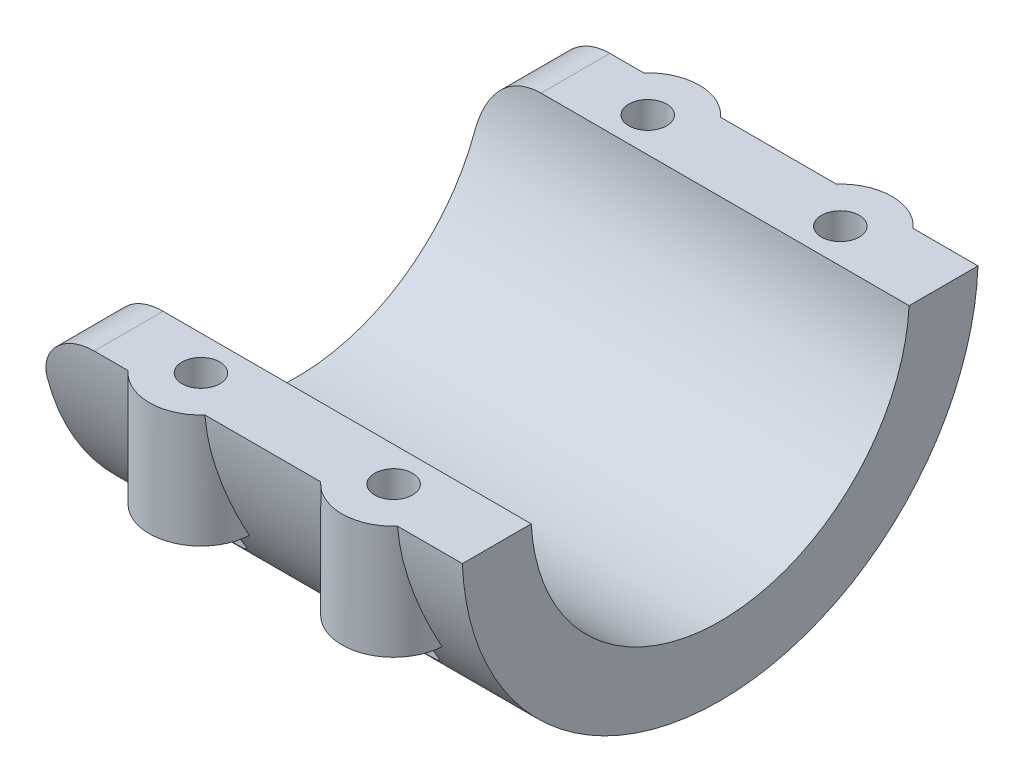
ISO-10303-21;
HEADER;
FILE_DESCRIPTION(('STEP AP214'),'2;1');
FILE_NAME('part.step','',(''),(''),'','','');
FILE_SCHEMA(('AUTOMOTIVE_DESIGN { 1 0 10303 214 1 1 1 1 }'));
ENDSEC;
DATA;
#1=APPLICATION_CONTEXT('core data for automotive mechanical design processes');
#2=APPLICATION_PROTOCOL_DEFINITION('international standard','automotive_design',2000,#1);
#3=PRODUCT_CONTEXT('',#1,'mechanical');
#4=PRODUCT('Part','Part','',(#3));
#5=PRODUCT_RELATED_PRODUCT_CATEGORY('part','',(#4));
#6=PRODUCT_DEFINITION_FORMATION('','',#4);
#7=PRODUCT_DEFINITION_CONTEXT('part definition',#1,'design');
#8=PRODUCT_DEFINITION('design','',#6,#7);
#9=PRODUCT_DEFINITION_SHAPE('','',#8);
#10=(LENGTH_UNIT() NAMED_UNIT(*) SI_UNIT(.MILLI.,.METRE.));
#11=(NAMED_UNIT(*) PLANE_ANGLE_UNIT() SI_UNIT($,.RADIAN.));
#12=(NAMED_UNIT(*) SI_UNIT($,.STERADIAN.) SOLID_ANGLE_UNIT());
#13=UNCERTAINTY_MEASURE_WITH_UNIT(LENGTH_MEASURE(1.E-05),#10,'distance_accuracy_value','');
#14=(GEOMETRIC_REPRESENTATION_CONTEXT(3) GLOBAL_UNCERTAINTY_ASSIGNED_CONTEXT((#13)) GLOBAL_UNIT_ASSIGNED_CONTEXT((#10,
#11,#12)) REPRESENTATION_CONTEXT('',''));
#15=CARTESIAN_POINT('',(0.,0.,0.));
#16=DIRECTION('',(0.,0.,1.));
#17=DIRECTION('',(1.,0.,0.));
#18=AXIS2_PLACEMENT_3D('',#15,#16,#17);
#19=CARTESIAN_POINT('',(46.,-1.5,-37.5));
#20=DIRECTION('',(0.,-1.,0.));
#21=DIRECTION('',(0.,0.,-1.));
#22=AXIS2_PLACEMENT_3D('',#19,#20,#21);
#23=PLANE('',#22);
#24=CARTESIAN_POINT('',(57.,-1.5,32.4645242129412));
#25=DIRECTION('',(0.,1.,0.));
#26=DIRECTION('',(0.,0.,-1.));
#27=AXIS2_PLACEMENT_3D('',#24,#25,#26);
#28=CIRCLE('',#27,2.75000000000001);
#29=CARTESIAN_POINT('',(57.,-1.5,29.7145242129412));
#30=VERTEX_POINT('',#29);
#31=EDGE_CURVE('E240',#30,#30,#28,.T.);
#32=ORIENTED_EDGE('',*,*,#31,.F.);
#33=EDGE_LOOP('',(#32));
#34=FACE_BOUND('',#33,.T.);
#35=CARTESIAN_POINT('',(85.,-1.5,32.4645242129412));
#36=DIRECTION('',(0.,1.,0.));
#37=DIRECTION('',(0.,0.,-1.));
#38=AXIS2_PLACEMENT_3D('',#35,#36,#37);
#39=CIRCLE('',#38,2.75000000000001);
#40=CARTESIAN_POINT('',(85.,-1.5,29.7145242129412));
#41=VERTEX_POINT('',#40);
#42=EDGE_CURVE('E244',#41,#41,#39,.T.);
#43=ORIENTED_EDGE('',*,*,#42,.F.);
#44=EDGE_LOOP('',(#43));
#45=FACE_BOUND('',#44,.T.);
#46=DIRECTION('',(0.,0.,1.));
#47=VECTOR('',#46,1.);
#48=CARTESIAN_POINT('',(46.5,-1.5,-39.9645242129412));
#49=LINE('',#48,#47);
#50=CARTESIAN_POINT('',(46.5,-1.5,27.459060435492));
#51=VERTEX_POINT('',#50);
#52=CARTESIAN_POINT('',(46.5,-1.5,37.4699879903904));
#53=VERTEX_POINT('',#52);
#54=EDGE_CURVE('E162',#51,#53,#49,.T.);
#55=ORIENTED_EDGE('',*,*,#54,.T.);
#56=DIRECTION('',(-1.,0.,0.));
#57=VECTOR('',#56,1.);
#58=CARTESIAN_POINT('',(0.,-1.5,37.4699879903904));
#59=LINE('',#58,#57);
#60=CARTESIAN_POINT('',(51.4147218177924,-1.5,37.4699879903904));
#61=VERTEX_POINT('',#60);
#62=EDGE_CURVE('E177',#61,#53,#59,.T.);
#63=ORIENTED_EDGE('',*,*,#62,.F.);
#64=CARTESIAN_POINT('',(57.,-1.5,32.4645242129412));
#65=DIRECTION('',(0.,1.,0.));
#66=DIRECTION('',(0.,0.,1.));
#67=AXIS2_PLACEMENT_3D('',#64,#65,#66);
#68=CIRCLE('',#67,7.5);
#69=CARTESIAN_POINT('',(62.5852781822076,-1.5,37.4699879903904));
#70=VERTEX_POINT('',#69);
#71=EDGE_CURVE('E265',#61,#70,#68,.T.);
#72=ORIENTED_EDGE('',*,*,#71,.T.);
#73=CARTESIAN_POINT('',(79.4147218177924,-1.5,37.4699879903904));
#74=VERTEX_POINT('',#73);
#75=EDGE_CURVE('E182',#74,#70,#59,.T.);
#76=ORIENTED_EDGE('',*,*,#75,.F.);
#77=CARTESIAN_POINT('',(85.,-1.5,32.4645242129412));
#78=DIRECTION('',(0.,1.,0.));
#79=DIRECTION('',(0.,0.,1.));
#80=AXIS2_PLACEMENT_3D('',#77,#78,#79);
#81=CIRCLE('',#80,7.5);
#82=CARTESIAN_POINT('',(90.5852781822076,-1.5,37.4699879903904));
#83=VERTEX_POINT('',#82);
#84=EDGE_CURVE('E261',#74,#83,#81,.T.);
#85=ORIENTED_EDGE('',*,*,#84,.T.);
#86=CARTESIAN_POINT('',(100.,-1.5,37.4699879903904));
#87=VERTEX_POINT('',#86);
#88=EDGE_CURVE('E184',#87,#83,#59,.T.);
#89=ORIENTED_EDGE('',*,*,#88,.F.);
#90=DIRECTION('',(0.,0.,1.));
#91=VECTOR('',#90,1.);
#92=CARTESIAN_POINT('',(100.,-1.5,-37.5));
#93=LINE('',#92,#91);
#94=CARTESIAN_POINT('',(100.,-1.5,27.459060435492));
#95=VERTEX_POINT('',#94);
#96=EDGE_CURVE('E204',#95,#87,#93,.T.);
#97=ORIENTED_EDGE('',*,*,#96,.F.);
#98=DIRECTION('',(-1.,0.,0.));
#99=VECTOR('',#98,1.);
#100=CARTESIAN_POINT('',(0.,-1.5,27.459060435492));
#101=LINE('',#100,#99);
#102=EDGE_CURVE('E197',#51,#95,#101,.F.);
#103=ORIENTED_EDGE('',*,*,#102,.F.);
#104=EDGE_LOOP('',(#55,#63,#72,#76,#85,#89,#97,#103));
#105=FACE_BOUND('',#104,.T.);
#106=ADVANCED_FACE('F29',(#34,#45,#105),#23,.F.);
#107=CARTESIAN_POINT('',(85.,-1.5,-32.4645242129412));
#108=DIRECTION('',(0.,1.,0.));
#109=DIRECTION('',(0.,0.,1.));
#110=AXIS2_PLACEMENT_3D('',#107,#108,#109);
#111=CIRCLE('',#110,2.75000000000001);
#112=CARTESIAN_POINT('',(85.,-1.5,-29.7145242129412));
#113=VERTEX_POINT('',#112);
#114=EDGE_CURVE('E380',#113,#113,#111,.T.);
#115=ORIENTED_EDGE('',*,*,#114,.F.);
#116=EDGE_LOOP('',(#115));
#117=FACE_BOUND('',#116,.T.);
#118=CARTESIAN_POINT('',(57.,-1.5,-32.4645242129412));
#119=DIRECTION('',(0.,1.,0.));
#120=DIRECTION('',(0.,0.,1.));
#121=AXIS2_PLACEMENT_3D('',#118,#119,#120);
#122=CIRCLE('',#121,2.75000000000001);
#123=CARTESIAN_POINT('',(57.,-1.5,-29.7145242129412));
#124=VERTEX_POINT('',#123);
#125=EDGE_CURVE('E386',#124,#124,#122,.T.);
#126=ORIENTED_EDGE('',*,*,#125,.F.);
#127=EDGE_LOOP('',(#126));
#128=FACE_BOUND('',#127,.T.);
#129=CARTESIAN_POINT('',(46.5,-1.5,-37.4699879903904));
#130=VERTEX_POINT('',#129);
#131=CARTESIAN_POINT('',(46.5,-1.5,-27.459060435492));
#132=VERTEX_POINT('',#131);
#133=EDGE_CURVE('E153',#130,#132,#49,.T.);
#134=ORIENTED_EDGE('',*,*,#133,.T.);
#135=DIRECTION('',(-1.,0.,0.));
#136=VECTOR('',#135,1.);
#137=CARTESIAN_POINT('',(0.,-1.5,-27.459060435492));
#138=LINE('',#137,#136);
#139=CARTESIAN_POINT('',(100.,-1.5,-27.459060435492));
#140=VERTEX_POINT('',#139);
#141=EDGE_CURVE('E201',#140,#132,#138,.T.);
#142=ORIENTED_EDGE('',*,*,#141,.F.);
#143=CARTESIAN_POINT('',(100.,-1.5,-37.4699879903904));
#144=VERTEX_POINT('',#143);
#145=EDGE_CURVE('E203',#144,#140,#93,.T.);
#146=ORIENTED_EDGE('',*,*,#145,.F.);
#147=DIRECTION('',(-1.,0.,0.));
#148=VECTOR('',#147,1.);
#149=CARTESIAN_POINT('',(0.,-1.5,-37.4699879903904));
#150=LINE('',#149,#148);
#151=CARTESIAN_POINT('',(90.5852781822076,-1.5,-37.4699879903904));
#152=VERTEX_POINT('',#151);
#153=EDGE_CURVE('E180',#152,#144,#150,.F.);
#154=ORIENTED_EDGE('',*,*,#153,.F.);
#155=CARTESIAN_POINT('',(85.,-1.5,-32.4645242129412));
#156=DIRECTION('',(0.,1.,0.));
#157=DIRECTION('',(0.,0.,-1.));
#158=AXIS2_PLACEMENT_3D('',#155,#156,#157);
#159=CIRCLE('',#158,7.5);
#160=CARTESIAN_POINT('',(79.4147218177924,-1.5,-37.4699879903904));
#161=VERTEX_POINT('',#160);
#162=EDGE_CURVE('E355',#152,#161,#159,.T.);
#163=ORIENTED_EDGE('',*,*,#162,.T.);
#164=CARTESIAN_POINT('',(62.5852781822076,-1.5,-37.4699879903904));
#165=VERTEX_POINT('',#164);
#166=EDGE_CURVE('E178',#165,#161,#150,.F.);
#167=ORIENTED_EDGE('',*,*,#166,.F.);
#168=CARTESIAN_POINT('',(57.,-1.5,-32.4645242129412));
#169=DIRECTION('',(0.,1.,0.));
#170=DIRECTION('',(0.,0.,-1.));
#171=AXIS2_PLACEMENT_3D('',#168,#169,#170);
#172=CIRCLE('',#171,7.5);
#173=CARTESIAN_POINT('',(51.4147218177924,-1.5,-37.4699879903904));
#174=VERTEX_POINT('',#173);
#175=EDGE_CURVE('E176',#165,#174,#172,.T.);
#176=ORIENTED_EDGE('',*,*,#175,.T.);
#177=EDGE_CURVE('E168',#130,#174,#150,.F.);
#178=ORIENTED_EDGE('',*,*,#177,.F.);
#179=EDGE_LOOP('',(#134,#142,#146,#154,#163,#167,#176,#178));
#180=FACE_BOUND('',#179,.T.);
#181=ADVANCED_FACE('F174',(#117,#128,#180),#23,.F.);
#182=CARTESIAN_POINT('',(0.,0.,0.));
#183=DIRECTION('',(-1.,0.,0.));
#184=DIRECTION('',(0.,0.,1.));
#185=AXIS2_PLACEMENT_3D('',#182,#183,#184);
#186=CYLINDRICAL_SURFACE('',#185,37.5);
#187=CARTESIAN_POINT('',(38.5,0.,0.));
#188=DIRECTION('',(1.,0.,0.));
#189=DIRECTION('',(0.,1.,0.));
#190=AXIS2_PLACEMENT_3D('',#187,#188,#189);
#191=CIRCLE('',#190,37.5);
#192=CARTESIAN_POINT('',(38.5,-9.5,36.2767142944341));
#193=VERTEX_POINT('',#192);
#194=CARTESIAN_POINT('',(38.5,-9.5,-36.2767142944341));
#195=VERTEX_POINT('',#194);
#196=EDGE_CURVE('E171',#193,#195,#191,.T.);
#197=ORIENTED_EDGE('',*,*,#196,.T.);
#198=CARTESIAN_POINT('',(54.5,-9.5,-36.2767142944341));
#199=CARTESIAN_POINT('',(54.5000022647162,-9.73530733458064,-36.2150944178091));
#200=CARTESIAN_POINT('',(54.4896146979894,-9.96997382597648,-36.1511878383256));
#201=CARTESIAN_POINT('',(54.4484531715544,-10.4364374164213,-36.0192935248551));
#202=CARTESIAN_POINT('',(54.4176733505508,-10.6682336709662,-35.9513046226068));
#203=CARTESIAN_POINT('',(54.3361842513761,-11.1274721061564,-35.8118280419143));
#204=CARTESIAN_POINT('',(54.285454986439,-11.3549096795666,-35.7403369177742));
#205=CARTESIAN_POINT('',(54.1646355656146,-11.8037802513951,-35.5946130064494));
#206=CARTESIAN_POINT('',(54.0945378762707,-12.0252108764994,-35.520379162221));
#207=CARTESIAN_POINT('',(53.9358408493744,-12.4600161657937,-35.3701960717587));
#208=CARTESIAN_POINT('',(53.8472897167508,-12.6734101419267,-35.2942517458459));
#209=CARTESIAN_POINT('',(53.6522140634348,-13.0915281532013,-35.1413071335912));
#210=CARTESIAN_POINT('',(53.5456828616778,-13.2962489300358,-35.0643064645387));
#211=CARTESIAN_POINT('',(53.3153906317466,-13.6956620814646,-34.9102370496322));
#212=CARTESIAN_POINT('',(53.1916335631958,-13.8903567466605,-34.8331683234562));
#213=CARTESIAN_POINT('',(52.9275857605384,-14.2685779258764,-34.6799556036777));
#214=CARTESIAN_POINT('',(52.7872951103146,-14.4521044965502,-34.6038116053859));
#215=CARTESIAN_POINT('',(52.486901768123,-14.8116243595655,-34.4514865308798));
#216=CARTESIAN_POINT('',(52.3263654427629,-14.9872790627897,-34.3753602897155));
#217=CARTESIAN_POINT('',(51.9895724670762,-15.3241995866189,-34.2264929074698));
#218=CARTESIAN_POINT('',(51.8133237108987,-15.4854725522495,-34.1537500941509));
#219=CARTESIAN_POINT('',(51.44589558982,-15.7924922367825,-34.0128760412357));
#220=CARTESIAN_POINT('',(51.2547088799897,-15.9382312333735,-33.9447471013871));
#221=CARTESIAN_POINT('',(50.8586773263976,-16.2126695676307,-33.8145295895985));
#222=CARTESIAN_POINT('',(50.6538397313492,-16.3413778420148,-33.7524378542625));
#223=CARTESIAN_POINT('',(50.2406867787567,-16.5753946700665,-33.6381113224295));
#224=CARTESIAN_POINT('',(50.0328877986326,-16.6814643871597,-33.5855700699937));
#225=CARTESIAN_POINT('',(49.6073536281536,-16.8755680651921,-33.4884604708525));
#226=CARTESIAN_POINT('',(49.3896236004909,-16.9636112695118,-33.4438880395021));
#227=CARTESIAN_POINT('',(48.945896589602,-17.1205600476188,-33.3638156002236));
#228=CARTESIAN_POINT('',(48.7199047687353,-17.1894773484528,-33.3283100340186));
#229=CARTESIAN_POINT('',(48.2614403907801,-17.3072607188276,-33.267298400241));
#230=CARTESIAN_POINT('',(48.0289686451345,-17.3561292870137,-33.2417910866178));
#231=CARTESIAN_POINT('',(47.5849916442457,-17.4289226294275,-33.2036766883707));
#232=CARTESIAN_POINT('',(47.3739252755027,-17.4549672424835,-33.1899759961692));
#233=CARTESIAN_POINT('',(46.9500069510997,-17.4901637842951,-33.1714421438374));
#234=CARTESIAN_POINT('',(46.7371551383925,-17.4993170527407,-33.1666082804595));
#235=CARTESIAN_POINT('',(46.3114494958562,-17.5006091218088,-33.1659264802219));
#236=CARTESIAN_POINT('',(46.0985956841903,-17.4927528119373,-33.1700759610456));
#237=CARTESIAN_POINT('',(45.6745512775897,-17.460141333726,-33.1872536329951));
#238=CARTESIAN_POINT('',(45.463360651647,-17.4353864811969,-33.2002816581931));
#239=CARTESIAN_POINT('',(45.0573178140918,-17.371356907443,-33.2338257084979));
#240=CARTESIAN_POINT('',(44.862264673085,-17.3330779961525,-33.253827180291));
#241=CARTESIAN_POINT('',(44.4763000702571,-17.2423479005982,-33.3009617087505));
#242=CARTESIAN_POINT('',(44.2853899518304,-17.1898921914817,-33.3280970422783));
#243=CARTESIAN_POINT('',(43.9089874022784,-17.0713656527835,-33.3889638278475));
#244=CARTESIAN_POINT('',(43.7234936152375,-17.0052982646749,-33.4226936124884));
#245=CARTESIAN_POINT('',(43.3588329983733,-16.8601361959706,-33.4961553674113));
#246=CARTESIAN_POINT('',(43.1796686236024,-16.7810365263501,-33.5358896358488));
#247=CARTESIAN_POINT('',(42.8204319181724,-16.6065097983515,-33.622667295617));
#248=CARTESIAN_POINT('',(42.6407070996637,-16.5104932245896,-33.669965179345));
#249=CARTESIAN_POINT('',(42.290096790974,-16.3057318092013,-33.7696031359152));
#250=CARTESIAN_POINT('',(42.1192145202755,-16.1969823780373,-33.8219450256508));
#251=CARTESIAN_POINT('',(41.6210380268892,-15.8528289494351,-33.9853227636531));
#252=CARTESIAN_POINT('',(41.3080174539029,-15.5994234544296,-34.1027594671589));
#253=CARTESIAN_POINT('',(40.6954298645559,-15.0228655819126,-34.3609270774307));
#254=CARTESIAN_POINT('',(40.4006240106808,-14.6952055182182,-34.5028107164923));
#255=CARTESIAN_POINT('',(39.869239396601,-13.9972462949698,-34.7918009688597));
#256=CARTESIAN_POINT('',(39.6326860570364,-13.6269286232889,-34.9389098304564));
#257=CARTESIAN_POINT('',(39.3180503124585,-13.0319953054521,-35.1634292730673));
#258=CARTESIAN_POINT('',(39.2173105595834,-12.8193204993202,-35.2415690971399));
#259=CARTESIAN_POINT('',(39.0347960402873,-12.3854873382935,-35.3963644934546));
#260=CARTESIAN_POINT('',(38.9530148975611,-12.1643318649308,-35.4730205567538));
#261=CARTESIAN_POINT('',(38.8090825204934,-11.7148407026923,-35.6239914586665));
#262=CARTESIAN_POINT('',(38.7469397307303,-11.4865019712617,-35.698305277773));
#263=CARTESIAN_POINT('',(38.6429996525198,-11.0243394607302,-35.8437244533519));
#264=CARTESIAN_POINT('',(38.6011936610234,-10.7905180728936,-35.9148311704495));
#265=CARTESIAN_POINT('',(38.5386504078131,-10.320276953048,-36.0527610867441));
#266=CARTESIAN_POINT('',(38.5177956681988,-10.0838793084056,-36.1196061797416));
#267=CARTESIAN_POINT('',(38.4972157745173,-9.60904264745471,-36.248818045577));
#268=CARTESIAN_POINT('',(38.497482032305,-9.37060450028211,-36.3111866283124));
#269=CARTESIAN_POINT('',(38.5194508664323,-8.89348377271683,-36.43098188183));
#270=CARTESIAN_POINT('',(38.5411519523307,-8.65480121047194,-36.4884088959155));
#271=CARTESIAN_POINT('',(38.6061417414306,-8.17916490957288,-36.5979618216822));
#272=CARTESIAN_POINT('',(38.6494293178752,-7.94221108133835,-36.6500880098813));
#273=CARTESIAN_POINT('',(38.7546836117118,-7.48448968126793,-36.7462134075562));
#274=CARTESIAN_POINT('',(38.8155457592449,-7.26352716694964,-36.7904961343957));
#275=CARTESIAN_POINT('',(38.9563533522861,-6.82679429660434,-36.8740329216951));
#276=CARTESIAN_POINT('',(39.0362980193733,-6.61102372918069,-36.9132871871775));
#277=CARTESIAN_POINT('',(39.2148278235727,-6.18650006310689,-36.9868033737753));
#278=CARTESIAN_POINT('',(39.3134097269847,-5.97774575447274,-37.0210661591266));
#279=CARTESIAN_POINT('',(39.5286020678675,-5.56897510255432,-37.0847584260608));
#280=CARTESIAN_POINT('',(39.6452121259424,-5.3689585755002,-37.1141880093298));
#281=CARTESIAN_POINT('',(39.8907532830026,-4.9869767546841,-37.167402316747));
#282=CARTESIAN_POINT('',(40.0190247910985,-4.80461149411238,-37.1913626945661));
#283=CARTESIAN_POINT('',(40.2905990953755,-4.45093602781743,-37.2353451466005));
#284=CARTESIAN_POINT('',(40.433901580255,-4.27962559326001,-37.2553673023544));
#285=CARTESIAN_POINT('',(40.7345330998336,-3.94939199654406,-37.2918209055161));
#286=CARTESIAN_POINT('',(40.8918615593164,-3.79046832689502,-37.3082525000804));
#287=CARTESIAN_POINT('',(41.2194357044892,-3.48621504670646,-37.3379120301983));
#288=CARTESIAN_POINT('',(41.3896814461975,-3.34088549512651,-37.3511399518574));
#289=CARTESIAN_POINT('',(41.7406031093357,-3.06591317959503,-37.3747118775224));
#290=CARTESIAN_POINT('',(41.9211951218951,-2.93616501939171,-37.3850759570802));
#291=CARTESIAN_POINT('',(42.2926999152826,-2.69206024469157,-37.4034464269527));
#292=CARTESIAN_POINT('',(42.4836162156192,-2.57770892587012,-37.411452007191));
#293=CARTESIAN_POINT('',(42.8743342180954,-2.36529714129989,-37.4254819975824));
#294=CARTESIAN_POINT('',(43.0741344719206,-2.26723403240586,-37.4315067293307));
#295=CARTESIAN_POINT('',(43.4812484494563,-2.08807714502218,-37.4419282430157));
#296=CARTESIAN_POINT('',(43.6885623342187,-2.00698373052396,-37.4463249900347));
#297=CARTESIAN_POINT('',(44.1105378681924,-1.86190120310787,-37.453820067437));
#298=CARTESIAN_POINT('',(44.3252367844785,-1.79802004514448,-37.4569102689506));
#299=CARTESIAN_POINT('',(44.7592510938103,-1.68847729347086,-37.4620081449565));
#300=CARTESIAN_POINT('',(44.9785666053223,-1.64281616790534,-37.4640157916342));
#301=CARTESIAN_POINT('',(45.4202256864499,-1.57004607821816,-37.4671360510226));
#302=CARTESIAN_POINT('',(45.6425687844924,-1.54293425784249,-37.4682488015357));
#303=CARTESIAN_POINT('',(46.0888201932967,-1.50743796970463,-37.46969371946));
#304=CARTESIAN_POINT('',(46.3127289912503,-1.49905961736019,-37.4700256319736));
#305=CARTESIAN_POINT('',(46.7612290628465,-1.50111129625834,-37.4699435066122));
#306=CARTESIAN_POINT('',(46.9858200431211,-1.51160593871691,-37.4695269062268));
#307=CARTESIAN_POINT('',(47.4333198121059,-1.55145451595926,-37.4678980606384));
#308=CARTESIAN_POINT('',(47.6562285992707,-1.58080846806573,-37.4666858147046));
#309=CARTESIAN_POINT('',(48.0988192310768,-1.6581728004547,-37.463341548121));
#310=CARTESIAN_POINT('',(48.3185004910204,-1.70618651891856,-37.4612093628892));
#311=CARTESIAN_POINT('',(48.7529596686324,-1.82050704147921,-37.4558276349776));
#312=CARTESIAN_POINT('',(48.9677391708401,-1.88680784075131,-37.4525784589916));
#313=CARTESIAN_POINT('',(49.3909972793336,-2.03725292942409,-37.4446961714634));
#314=CARTESIAN_POINT('',(49.5994741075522,-2.12140220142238,-37.4400626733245));
#315=CARTESIAN_POINT('',(50.0085683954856,-2.30692067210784,-37.4290895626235));
#316=CARTESIAN_POINT('',(50.209186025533,-2.40828949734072,-37.4227499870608));
#317=CARTESIAN_POINT('',(50.6011231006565,-2.62750370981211,-37.407997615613));
#318=CARTESIAN_POINT('',(50.792442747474,-2.74534873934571,-37.3995848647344));
#319=CARTESIAN_POINT('',(51.1644082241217,-2.99664158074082,-37.3802890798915));
#320=CARTESIAN_POINT('',(51.3450542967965,-3.13008903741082,-37.369406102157));
#321=CARTESIAN_POINT('',(51.6937953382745,-3.41111894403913,-37.3448000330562));
#322=CARTESIAN_POINT('',(51.8619300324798,-3.55865293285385,-37.3310865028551));
#323=CARTESIAN_POINT('',(52.1850521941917,-3.86705729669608,-37.3004003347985));
#324=CARTESIAN_POINT('',(52.3400443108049,-4.02792291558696,-37.2834288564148));
#325=CARTESIAN_POINT('',(52.6358933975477,-4.36185013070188,-37.245838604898));
#326=CARTESIAN_POINT('',(52.7767464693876,-4.53491506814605,-37.2252188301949));
#327=CARTESIAN_POINT('',(53.0432899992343,-4.8918584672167,-37.1799956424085));
#328=CARTESIAN_POINT('',(53.1689807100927,-5.07573674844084,-37.1553922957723));
#329=CARTESIAN_POINT('',(53.4036537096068,-5.45174316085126,-37.1020798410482));
#330=CARTESIAN_POINT('',(53.5127316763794,-5.64381520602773,-37.0733962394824));
#331=CARTESIAN_POINT('',(53.714395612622,-6.0357442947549,-37.0116082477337));
#332=CARTESIAN_POINT('',(53.8069816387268,-6.2356013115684,-36.9785038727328));
#333=CARTESIAN_POINT('',(53.975071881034,-6.64141789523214,-36.9077761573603));
#334=CARTESIAN_POINT('',(54.0505892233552,-6.84737263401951,-36.870156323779));
#335=CARTESIAN_POINT('',(54.1842543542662,-7.26391166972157,-36.790359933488));
#336=CARTESIAN_POINT('',(54.242405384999,-7.47449509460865,-36.7481842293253));
#337=CARTESIAN_POINT('',(54.3613062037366,-7.98544208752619,-36.641175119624));
#338=CARTESIAN_POINT('',(54.4134381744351,-8.28738494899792,-36.574117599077));
#339=CARTESIAN_POINT('',(54.4827837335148,-8.89323904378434,-36.4315408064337));
#340=CARTESIAN_POINT('',(54.499997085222,-9.19715029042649,-36.3560214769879));
#341=CARTESIAN_POINT('',(54.5,-9.5,-36.2767142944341));
#342=B_SPLINE_CURVE_WITH_KNOTS('',3,(#198,#199,#200,#201,#202,#203,#204,#205,#206,#207,#208,
#209,#210,#211,#212,#213,#214,#215,#216,#217,#218,#219,#220,#221,#222,#223,#224,#225,#226,#227,
#228,#229,#230,#231,#232,#233,#234,#235,#236,#237,#238,#239,#240,#241,#242,#243,#244,#245,#246,
#247,#248,#249,#250,#251,#252,#253,#254,#255,#256,#257,#258,#259,#260,#261,#262,#263,#264,#265,
#266,#267,#268,#269,#270,#271,#272,#273,#274,#275,#276,#277,#278,#279,#280,#281,#282,#283,#284,
#285,#286,#287,#288,#289,#290,#291,#292,#293,#294,#295,#296,#297,#298,#299,#300,#301,#302,#303,
#304,#305,#306,#307,#308,#309,#310,#311,#312,#313,#314,#315,#316,#317,#318,#319,#320,#321,#322,
#323,#324,#325,#326,#327,#328,#329,#330,#331,#332,#333,#334,#335,#336,#337,#338,#339,#340,#341),
.UNSPECIFIED.,.T.,.F.,(4,2,2,2,2,2,2,2,2,2,2,2,2,2,2,2,2,2,2,2,2,2,2,2,2,2,2,2,2,2,2,2,2,2,2,2,
2,2,2,2,2,2,2,2,2,2,2,2,2,2,2,2,2,2,2,2,2,2,2,2,2,2,2,2,2,2,2,2,2,2,2,4),(0.,0.729430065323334,
1.45906987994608,2.18944256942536,2.92009974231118,3.64887166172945,4.37791497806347,
5.10679098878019,5.83566330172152,6.58427360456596,7.33250989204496,8.08111642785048,
8.82932856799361,9.54579242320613,10.2618879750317,10.9775434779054,11.693109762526,
12.3315979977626,12.9700355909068,13.6082896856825,14.2465318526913,14.845187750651,
15.4440349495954,16.0427309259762,16.6416566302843,17.2685209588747,17.8956119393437,
19.1491278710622,20.5326318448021,21.9167384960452,22.6598897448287,23.4027906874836,
24.1460106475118,24.8889122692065,25.6276246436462,26.3660366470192,27.1043973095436,
27.8427194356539,28.5421333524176,29.2415187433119,29.9407828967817,30.6400323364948,
31.3119553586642,31.9838644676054,32.6557460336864,33.3276305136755,33.9946781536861,
34.6619546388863,35.3291227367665,35.9963051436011,36.6675795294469,37.3388711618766,
38.0100594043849,38.6814667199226,39.3551769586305,40.0288878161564,40.7027192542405,
41.3763296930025,42.050128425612,42.7239125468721,43.3976820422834,44.0714362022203,
44.7429507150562,45.4142266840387,46.0856872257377,46.75713656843,47.4245593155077,
48.09197977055,48.7588852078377,49.4256660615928,50.3644646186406,51.3032695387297),.UNSPECIFIED.);
#343=EDGE_CURVE('E156',#195,#130,#342,.T.);
#344=ORIENTED_EDGE('',*,*,#343,.T.);
#345=ORIENTED_EDGE('',*,*,#177,.T.);
#346=CARTESIAN_POINT('',(51.4147218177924,-1.5,-37.4699879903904));
#347=CARTESIAN_POINT('',(51.4063533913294,-1.73345455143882,-37.4606427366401));
#348=CARTESIAN_POINT('',(51.3960599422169,-1.96674158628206,-37.4491179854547));
#349=CARTESIAN_POINT('',(51.3718133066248,-2.43286035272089,-37.4217274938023));
#350=CARTESIAN_POINT('',(51.3578602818,-2.66569210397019,-37.4058619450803));
#351=CARTESIAN_POINT('',(51.3108093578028,-3.3631555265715,-37.3517950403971));
#352=CARTESIAN_POINT('',(51.272512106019,-3.82695575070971,-37.3071153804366));
#353=CARTESIAN_POINT('',(51.1842528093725,-4.75081071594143,-37.200749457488));
#354=CARTESIAN_POINT('',(51.1343064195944,-5.21086963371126,-37.1390859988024));
#355=CARTESIAN_POINT('',(51.0252960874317,-6.12735600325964,-36.9989247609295));
#356=CARTESIAN_POINT('',(50.9662313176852,-6.58378312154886,-36.9204254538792));
#357=CARTESIAN_POINT('',(50.8428373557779,-7.4848109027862,-36.7482566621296));
#358=CARTESIAN_POINT('',(50.7786154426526,-7.92948034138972,-36.6548695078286));
#359=CARTESIAN_POINT('',(50.6467710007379,-8.81461550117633,-36.452142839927));
#360=CARTESIAN_POINT('',(50.5791484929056,-9.25508124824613,-36.3428034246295));
#361=CARTESIAN_POINT('',(50.3752061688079,-10.5700408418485,-35.990939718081));
#362=CARTESIAN_POINT('',(50.2378004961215,-11.4381712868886,-35.7245557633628));
#363=CARTESIAN_POINT('',(50.0370300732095,-12.7836506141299,-35.2575395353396));
#364=CARTESIAN_POINT('',(49.9673468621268,-13.2676100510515,-35.0783044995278));
#365=CARTESIAN_POINT('',(49.8379775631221,-14.2287025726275,-34.6995773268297));
#366=CARTESIAN_POINT('',(49.7782871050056,-14.705838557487,-34.5000941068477));
#367=CARTESIAN_POINT('',(49.6725474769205,-15.6574200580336,-34.0788571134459));
#368=CARTESIAN_POINT('',(49.6266370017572,-16.1317939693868,-33.8569051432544));
#369=CARTESIAN_POINT('',(49.572106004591,-16.8371323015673,-33.5086531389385));
#370=CARTESIAN_POINT('',(49.5563139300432,-17.0713205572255,-33.3899535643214));
#371=CARTESIAN_POINT('',(49.5301697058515,-17.5374165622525,-33.1475194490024));
#372=CARTESIAN_POINT('',(49.5198182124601,-17.7693240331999,-33.0237843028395));
#373=CARTESIAN_POINT('',(49.5125122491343,-18.,-32.897568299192));
#374=B_SPLINE_CURVE_WITH_KNOTS('',3,(#346,#347,#348,#349,#350,#351,#352,#353,#354,#355,#356,
#357,#358,#359,#360,#361,#362,#363,#364,#365,#366,#367,#368,#369,#370,#371,#372,#373),
.UNSPECIFIED.,.F.,.F.,(4,2,2,2,2,2,2,2,2,2,2,2,2,4),(0.,0.701335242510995,1.40263951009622,
2.80464662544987,4.20478035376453,5.60504119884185,6.98136022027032,8.35767076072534,
11.1100631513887,12.6719446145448,14.233141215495,15.8095613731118,16.5985405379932,
17.3876148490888),.UNSPECIFIED.);
#375=CARTESIAN_POINT('',(49.5125122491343,-18.,-32.897568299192));
#376=VERTEX_POINT('',#375);
#377=EDGE_CURVE('E273',#174,#376,#374,.T.);
#378=ORIENTED_EDGE('',*,*,#377,.T.);
#379=DIRECTION('',(-1.,0.,0.));
#380=VECTOR('',#379,1.);
#381=CARTESIAN_POINT('',(0.,-18.,-32.897568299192));
#382=LINE('',#381,#380);
#383=CARTESIAN_POINT('',(52.5208848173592,-18.,-32.897568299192));
#384=VERTEX_POINT('',#383);
#385=EDGE_CURVE('E373',#376,#384,#382,.F.);
#386=ORIENTED_EDGE('',*,*,#385,.T.);
#387=CARTESIAN_POINT('',(61.4790975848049,-17.9998,-32.8976777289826));
#388=CARTESIAN_POINT('',(61.4931448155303,-18.1595193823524,-32.8102897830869));
#389=CARTESIAN_POINT('',(61.5046987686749,-18.3187782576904,-32.7216390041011));
#390=CARTESIAN_POINT('',(61.5224572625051,-18.6362433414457,-32.541875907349));
#391=CARTESIAN_POINT('',(61.5286606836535,-18.7944493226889,-32.4507630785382));
#392=CARTESIAN_POINT('',(61.5353609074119,-19.1101676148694,-32.2658500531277));
#393=CARTESIAN_POINT('',(61.5358374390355,-19.26767549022,-32.1720414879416));
#394=CARTESIAN_POINT('',(61.5305993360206,-19.5812073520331,-31.9821813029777));
#395=CARTESIAN_POINT('',(61.5248850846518,-19.7372314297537,-31.8861298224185));
#396=CARTESIAN_POINT('',(61.4975799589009,-20.2057672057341,-31.5929339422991));
#397=CARTESIAN_POINT('',(61.465744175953,-20.5157272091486,-31.3925138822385));
#398=CARTESIAN_POINT('',(61.370292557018,-21.1258866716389,-30.9851743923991));
#399=CARTESIAN_POINT('',(61.3067285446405,-21.4261011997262,-30.7782660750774));
#400=CARTESIAN_POINT('',(61.1856023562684,-21.8579926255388,-30.4714136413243));
#401=CARTESIAN_POINT('',(61.1426635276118,-21.994788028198,-30.372806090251));
#402=CARTESIAN_POINT('',(61.0477129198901,-22.2650030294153,-30.1752813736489));
#403=CARTESIAN_POINT('',(60.9957010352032,-22.3984225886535,-30.0763642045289));
#404=CARTESIAN_POINT('',(60.8818539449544,-22.6612082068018,-29.8788663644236));
#405=CARTESIAN_POINT('',(60.8200219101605,-22.7905755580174,-29.7802855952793));
#406=CARTESIAN_POINT('',(60.6856918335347,-23.0445348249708,-29.58420426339));
#407=CARTESIAN_POINT('',(60.6131940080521,-23.1691268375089,-29.4867036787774));
#408=CARTESIAN_POINT('',(60.4555299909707,-23.4143569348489,-29.2923661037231));
#409=CARTESIAN_POINT('',(60.370195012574,-23.5349112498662,-29.1955593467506));
#410=CARTESIAN_POINT('',(60.1867468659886,-23.7689166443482,-29.005367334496));
#411=CARTESIAN_POINT('',(60.0886307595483,-23.8823660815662,-28.9119828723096));
#412=CARTESIAN_POINT('',(59.8791886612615,-24.100228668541,-28.7306281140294));
#413=CARTESIAN_POINT('',(59.7679077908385,-24.2046706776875,-28.6426408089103));
#414=CARTESIAN_POINT('',(59.5313948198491,-24.4030109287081,-28.4738479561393));
#415=CARTESIAN_POINT('',(59.4061689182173,-24.4969138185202,-28.3930392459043));
#416=CARTESIAN_POINT('',(59.1207975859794,-24.6857861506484,-28.2290620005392));
#417=CARTESIAN_POINT('',(58.9582575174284,-24.7786017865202,-28.1475202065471));
#418=CARTESIAN_POINT('',(58.6154142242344,-24.9431620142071,-28.0018003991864));
#419=CARTESIAN_POINT('',(58.4351202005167,-25.0149174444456,-27.9376134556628));
#420=CARTESIAN_POINT('',(58.1533253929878,-25.1038987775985,-27.8575998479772));
#421=CARTESIAN_POINT('',(58.0570080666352,-25.130533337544,-27.8335637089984));
#422=CARTESIAN_POINT('',(57.8614546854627,-25.1769426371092,-27.7915912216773));
#423=CARTESIAN_POINT('',(57.7622201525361,-25.1967208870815,-27.7736517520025));
#424=CARTESIAN_POINT('',(57.5616685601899,-25.2290370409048,-27.7442997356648));
#425=CARTESIAN_POINT('',(57.460352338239,-25.2415777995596,-27.7328846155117));
#426=CARTESIAN_POINT('',(57.2565404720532,-25.2591774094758,-27.716855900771));
#427=CARTESIAN_POINT('',(57.1540449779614,-25.2642372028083,-27.7122414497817));
#428=CARTESIAN_POINT('',(56.9613552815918,-25.2666179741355,-27.7100706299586));
#429=CARTESIAN_POINT('',(56.8711787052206,-25.2648040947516,-27.7117252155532));
#430=CARTESIAN_POINT('',(56.6913564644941,-25.255353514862,-27.720338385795));
#431=CARTESIAN_POINT('',(56.6017109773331,-25.2477149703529,-27.7272986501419));
#432=CARTESIAN_POINT('',(56.4236861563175,-25.2267368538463,-27.7463862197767));
#433=CARTESIAN_POINT('',(56.335306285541,-25.2133997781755,-27.7585112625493));
#434=CARTESIAN_POINT('',(56.1603669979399,-25.1812351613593,-27.7876926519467));
#435=CARTESIAN_POINT('',(56.073808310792,-25.1624054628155,-27.804750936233));
#436=CARTESIAN_POINT('',(55.8213605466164,-25.0989765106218,-27.8620638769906));
#437=CARTESIAN_POINT('',(55.6587377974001,-25.0469503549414,-27.9089044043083));
#438=CARTESIAN_POINT('',(55.3456700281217,-24.9253865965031,-28.0175253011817));
#439=CARTESIAN_POINT('',(55.1952299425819,-24.8558419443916,-28.079311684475));
#440=CARTESIAN_POINT('',(54.8441945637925,-24.6676810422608,-28.2449517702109));
#441=CARTESIAN_POINT('',(54.6509794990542,-24.5409855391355,-28.3553042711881));
#442=CARTESIAN_POINT('',(54.2940317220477,-24.2638926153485,-28.5927761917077));
#443=CARTESIAN_POINT('',(54.1303633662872,-24.1134447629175,-28.7199311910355));
#444=CARTESIAN_POINT('',(53.872243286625,-23.8385285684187,-28.9481827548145));
#445=CARTESIAN_POINT('',(53.7711055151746,-23.7182140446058,-29.0468906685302));
#446=CARTESIAN_POINT('',(53.5827010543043,-23.4698855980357,-29.2479054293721));
#447=CARTESIAN_POINT('',(53.4954407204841,-23.3418681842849,-29.3502138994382));
#448=CARTESIAN_POINT('',(53.3337259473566,-23.0794278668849,-29.5570290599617));
#449=CARTESIAN_POINT('',(53.2592870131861,-22.9449974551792,-29.661538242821));
#450=CARTESIAN_POINT('',(53.1222764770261,-22.6709284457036,-29.8715391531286));
#451=CARTESIAN_POINT('',(53.0597089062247,-22.5312880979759,-29.9770312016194));
#452=CARTESIAN_POINT('',(52.9107829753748,-22.1616112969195,-30.252165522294));
#453=CARTESIAN_POINT('',(52.8330311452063,-21.9281465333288,-30.4218851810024));
#454=CARTESIAN_POINT('',(52.7019300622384,-21.4527682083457,-30.7589634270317));
#455=CARTESIAN_POINT('',(52.6485972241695,-21.2108490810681,-30.926320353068));
#456=CARTESIAN_POINT('',(52.5631713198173,-20.7201762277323,-31.2571912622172));
#457=CARTESIAN_POINT('',(52.5311144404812,-20.471411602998,-31.4206982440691));
#458=CARTESIAN_POINT('',(52.4857606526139,-19.9689689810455,-31.7423892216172));
#459=CARTESIAN_POINT('',(52.4724570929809,-19.7152927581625,-31.900575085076));
#460=CARTESIAN_POINT('',(52.4626761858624,-19.2186840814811,-32.2020437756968));
#461=CARTESIAN_POINT('',(52.4652778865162,-18.9759694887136,-32.3456610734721));
#462=CARTESIAN_POINT('',(52.4836624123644,-18.4891116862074,-32.6263920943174));
#463=CARTESIAN_POINT('',(52.4993708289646,-18.244984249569,-32.7635379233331));
#464=CARTESIAN_POINT('',(52.5209024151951,-17.9998,-32.8976777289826));
#465=B_SPLINE_CURVE_WITH_KNOTS('',3,(#387,#388,#389,#390,#391,#392,#393,#394,#395,#396,#397,
#398,#399,#400,#401,#402,#403,#404,#405,#406,#407,#408,#409,#410,#411,#412,#413,#414,#415,#416,
#417,#418,#419,#420,#421,#422,#423,#424,#425,#426,#427,#428,#429,#430,#431,#432,#433,#434,#435,
#436,#437,#438,#439,#440,#441,#442,#443,#444,#445,#446,#447,#448,#449,#450,#451,#452,#453,#454,
#455,#456,#457,#458,#459,#460,#461,#462,#463,#464),.UNSPECIFIED.,.F.,.F.,(4,2,2,2,2,2,2,2,2,2,2,
2,2,2,2,2,2,2,2,2,2,2,2,2,2,2,2,2,2,2,2,2,2,2,2,2,2,2,4),(0.,0.547803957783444,1.09572250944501,
1.64557991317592,2.1954032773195,3.30550775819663,4.41380494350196,4.93562291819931,
5.45744696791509,5.97910287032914,6.50074819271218,7.02997407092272,7.55932182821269,
8.08690515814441,8.61425489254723,9.22452170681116,9.83447390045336,10.1424412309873,
10.4502506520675,10.7579385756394,11.0655877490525,11.3358778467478,11.6062535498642,
11.8765109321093,12.1468746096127,12.67569680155,13.2047321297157,13.9686083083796,
14.7341287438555,15.2902062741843,15.8465377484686,16.403537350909,16.9607257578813,
17.8560696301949,18.752014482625,19.6494793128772,20.5466257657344,21.3923370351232,
22.2332794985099),.UNSPECIFIED.);
#466=CARTESIAN_POINT('',(61.4791151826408,-18.,-32.897568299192));
#467=VERTEX_POINT('',#466);
#468=EDGE_CURVE('E348',#467,#384,#465,.T.);
#469=ORIENTED_EDGE('',*,*,#468,.F.);
#470=CARTESIAN_POINT('',(64.4874877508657,-18.,-32.897568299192));
#471=VERTEX_POINT('',#470);
#472=EDGE_CURVE('E487',#467,#471,#382,.F.);
#473=ORIENTED_EDGE('',*,*,#472,.T.);
#474=CARTESIAN_POINT('',(64.4874877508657,-18.,-32.897568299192));
#475=CARTESIAN_POINT('',(64.4811253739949,-17.7990601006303,-33.0075137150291));
#476=CARTESIAN_POINT('',(64.4724496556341,-17.5971831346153,-33.1155784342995));
#477=CARTESIAN_POINT('',(64.4509050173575,-17.1916763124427,-33.3278957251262));
#478=CARTESIAN_POINT('',(64.4380364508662,-16.9880466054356,-33.4321486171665));
#479=CARTESIAN_POINT('',(64.3938044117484,-16.3748680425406,-33.7390362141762));
#480=CARTESIAN_POINT('',(64.3568072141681,-15.9628242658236,-33.935912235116));
#481=CARTESIAN_POINT('',(64.2710215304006,-15.1334860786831,-34.3137726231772));
#482=CARTESIAN_POINT('',(64.2222499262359,-14.716199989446,-34.4947792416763));
#483=CARTESIAN_POINT('',(64.1157924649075,-13.8762785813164,-34.8411434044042));
#484=CARTESIAN_POINT('',(64.0581055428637,-13.4536426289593,-35.006499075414));
#485=CARTESIAN_POINT('',(63.8779225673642,-12.1930558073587,-35.4735581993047));
#486=CARTESIAN_POINT('',(63.74661395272,-11.3479704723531,-35.7528195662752));
#487=CARTESIAN_POINT('',(63.4804171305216,-9.64056320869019,-36.2505237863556));
#488=CARTESIAN_POINT('',(63.345528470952,-8.77823910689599,-36.4689589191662));
#489=CARTESIAN_POINT('',(63.143115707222,-7.38633432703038,-36.769238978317));
#490=CARTESIAN_POINT('',(63.0702386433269,-6.86172215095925,-36.8707603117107));
#491=CARTESIAN_POINT('',(62.9348960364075,-5.80747775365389,-37.0514378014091));
#492=CARTESIAN_POINT('',(62.8724261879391,-5.27784770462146,-37.1306032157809));
#493=CARTESIAN_POINT('',(62.7893237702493,-4.47750618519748,-37.2327174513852));
#494=CARTESIAN_POINT('',(62.7632883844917,-4.20840211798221,-37.2640960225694));
#495=CARTESIAN_POINT('',(62.7153820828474,-3.66920780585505,-37.3210450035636));
#496=CARTESIAN_POINT('',(62.6935110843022,-3.39911758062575,-37.3466155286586));
#497=CARTESIAN_POINT('',(62.6543435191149,-2.85788632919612,-37.3919280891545));
#498=CARTESIAN_POINT('',(62.6370508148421,-2.58674461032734,-37.411665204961));
#499=CARTESIAN_POINT('',(62.60738921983,-2.04380862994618,-37.4452514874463));
#500=CARTESIAN_POINT('',(62.5950206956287,-1.77201432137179,-37.4591002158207));
#501=CARTESIAN_POINT('',(62.5852781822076,-1.5,-37.4699879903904));
#502=B_SPLINE_CURVE_WITH_KNOTS('',3,(#474,#475,#476,#477,#478,#479,#480,#481,#482,#483,#484,
#485,#486,#487,#488,#489,#490,#491,#492,#493,#494,#495,#496,#497,#498,#499,#500,#501),
.UNSPECIFIED.,.F.,.F.,(4,2,2,2,2,2,2,2,2,2,2,2,2,4),(0.,0.687371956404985,1.37468598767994,
2.7486118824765,4.12057943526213,5.49271098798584,8.18920737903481,10.8860458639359,
12.5034394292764,14.1201622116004,14.936610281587,15.7530421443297,16.570160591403,
17.3873398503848),.UNSPECIFIED.);
#503=EDGE_CURVE('E269',#471,#165,#502,.T.);
#504=ORIENTED_EDGE('',*,*,#503,.T.);
#505=ORIENTED_EDGE('',*,*,#166,.T.);
#506=CARTESIAN_POINT('',(79.4147218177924,-1.5,-37.4699879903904));
#507=CARTESIAN_POINT('',(79.4063533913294,-1.73345455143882,-37.4606427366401));
#508=CARTESIAN_POINT('',(79.3960599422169,-1.96674158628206,-37.4491179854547));
#509=CARTESIAN_POINT('',(79.3718133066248,-2.43286035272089,-37.4217274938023));
#510=CARTESIAN_POINT('',(79.3578602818,-2.66569210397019,-37.4058619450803));
#511=CARTESIAN_POINT('',(79.3108093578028,-3.3631555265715,-37.3517950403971));
#512=CARTESIAN_POINT('',(79.272512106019,-3.82695575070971,-37.3071153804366));
#513=CARTESIAN_POINT('',(79.1842528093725,-4.75081071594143,-37.200749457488));
#514=CARTESIAN_POINT('',(79.1343064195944,-5.21086963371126,-37.1390859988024));
#515=CARTESIAN_POINT('',(79.0252960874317,-6.12735600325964,-36.9989247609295));
#516=CARTESIAN_POINT('',(78.9662313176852,-6.58378312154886,-36.9204254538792));
#517=CARTESIAN_POINT('',(78.8428373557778,-7.4848109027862,-36.7482566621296));
#518=CARTESIAN_POINT('',(78.7786154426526,-7.92948034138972,-36.6548695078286));
#519=CARTESIAN_POINT('',(78.6467710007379,-8.81461550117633,-36.452142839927));
#520=CARTESIAN_POINT('',(78.5791484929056,-9.25508124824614,-36.3428034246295));
#521=CARTESIAN_POINT('',(78.3752061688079,-10.5700408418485,-35.990939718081));
#522=CARTESIAN_POINT('',(78.2378004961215,-11.4381712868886,-35.7245557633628));
#523=CARTESIAN_POINT('',(78.0370300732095,-12.7836506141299,-35.2575395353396));
#524=CARTESIAN_POINT('',(77.9673468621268,-13.2676100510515,-35.0783044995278));
#525=CARTESIAN_POINT('',(77.8379775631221,-14.2287025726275,-34.6995773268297));
#526=CARTESIAN_POINT('',(77.7782871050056,-14.705838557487,-34.5000941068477));
#527=CARTESIAN_POINT('',(77.6725474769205,-15.6574200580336,-34.0788571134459));
#528=CARTESIAN_POINT('',(77.6266370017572,-16.1317939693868,-33.8569051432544));
#529=CARTESIAN_POINT('',(77.572106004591,-16.8371323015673,-33.5086531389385));
#530=CARTESIAN_POINT('',(77.5563139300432,-17.0713205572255,-33.3899535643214));
#531=CARTESIAN_POINT('',(77.5301697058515,-17.5374165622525,-33.1475194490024));
#532=CARTESIAN_POINT('',(77.5198182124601,-17.7693240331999,-33.0237843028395));
#533=CARTESIAN_POINT('',(77.5125122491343,-18.,-32.897568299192));
#534=B_SPLINE_CURVE_WITH_KNOTS('',3,(#506,#507,#508,#509,#510,#511,#512,#513,#514,#515,#516,
#517,#518,#519,#520,#521,#522,#523,#524,#525,#526,#527,#528,#529,#530,#531,#532,#533),
.UNSPECIFIED.,.F.,.F.,(4,2,2,2,2,2,2,2,2,2,2,2,2,4),(0.,0.701335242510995,1.40263951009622,
2.80464662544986,4.20478035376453,5.60504119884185,6.98136022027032,8.35767076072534,
11.1100631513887,12.6719446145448,14.233141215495,15.8095613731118,16.5985405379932,
17.3876148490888),.UNSPECIFIED.);
#535=CARTESIAN_POINT('',(77.5125122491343,-18.,-32.897568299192));
#536=VERTEX_POINT('',#535);
#537=EDGE_CURVE('E318',#161,#536,#534,.T.);
#538=ORIENTED_EDGE('',*,*,#537,.T.);
#539=DIRECTION('',(-1.,0.,0.));
#540=VECTOR('',#539,1.);
#541=CARTESIAN_POINT('',(0.,-18.,-32.897568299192));
#542=LINE('',#541,#540);
#543=CARTESIAN_POINT('',(80.5208848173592,-18.,-32.897568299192));
#544=VERTEX_POINT('',#543);
#545=EDGE_CURVE('E38',#536,#544,#542,.F.);
#546=ORIENTED_EDGE('',*,*,#545,.T.);
#547=CARTESIAN_POINT('',(89.4790975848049,-17.9998,-32.8976777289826));
#548=CARTESIAN_POINT('',(89.4931448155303,-18.1595193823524,-32.8102897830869));
#549=CARTESIAN_POINT('',(89.5046987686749,-18.3187782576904,-32.7216390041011));
#550=CARTESIAN_POINT('',(89.5224572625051,-18.6362433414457,-32.541875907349));
#551=CARTESIAN_POINT('',(89.5286606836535,-18.7944493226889,-32.4507630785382));
#552=CARTESIAN_POINT('',(89.5353609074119,-19.1101676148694,-32.2658500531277));
#553=CARTESIAN_POINT('',(89.5358374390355,-19.26767549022,-32.1720414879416));
#554=CARTESIAN_POINT('',(89.5305993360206,-19.5812073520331,-31.9821813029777));
#555=CARTESIAN_POINT('',(89.5248850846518,-19.7372314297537,-31.8861298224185));
#556=CARTESIAN_POINT('',(89.4975799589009,-20.2057672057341,-31.5929339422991));
#557=CARTESIAN_POINT('',(89.465744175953,-20.5157272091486,-31.3925138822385));
#558=CARTESIAN_POINT('',(89.370292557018,-21.1258866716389,-30.9851743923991));
#559=CARTESIAN_POINT('',(89.3067285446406,-21.4261011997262,-30.7782660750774));
#560=CARTESIAN_POINT('',(89.1856023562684,-21.8579926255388,-30.4714136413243));
#561=CARTESIAN_POINT('',(89.1426635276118,-21.9947880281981,-30.372806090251));
#562=CARTESIAN_POINT('',(89.0477129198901,-22.2650030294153,-30.1752813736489));
#563=CARTESIAN_POINT('',(88.9957010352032,-22.3984225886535,-30.0763642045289));
#564=CARTESIAN_POINT('',(88.8818539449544,-22.6612082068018,-29.8788663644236));
#565=CARTESIAN_POINT('',(88.8200219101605,-22.7905755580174,-29.7802855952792));
#566=CARTESIAN_POINT('',(88.6856918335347,-23.0445348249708,-29.58420426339));
#567=CARTESIAN_POINT('',(88.6131940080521,-23.1691268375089,-29.4867036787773));
#568=CARTESIAN_POINT('',(88.4555299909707,-23.414356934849,-29.2923661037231));
#569=CARTESIAN_POINT('',(88.370195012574,-23.5349112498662,-29.1955593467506));
#570=CARTESIAN_POINT('',(88.1867468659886,-23.7689166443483,-29.005367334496));
#571=CARTESIAN_POINT('',(88.0886307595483,-23.8823660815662,-28.9119828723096));
#572=CARTESIAN_POINT('',(87.8791886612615,-24.100228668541,-28.7306281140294));
#573=CARTESIAN_POINT('',(87.7679077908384,-24.2046706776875,-28.6426408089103));
#574=CARTESIAN_POINT('',(87.5313948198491,-24.4030109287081,-28.4738479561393));
#575=CARTESIAN_POINT('',(87.4061689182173,-24.4969138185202,-28.3930392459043));
#576=CARTESIAN_POINT('',(87.1207975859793,-24.6857861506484,-28.2290620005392));
#577=CARTESIAN_POINT('',(86.9582575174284,-24.7786017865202,-28.1475202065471));
#578=CARTESIAN_POINT('',(86.6154142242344,-24.9431620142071,-28.0018003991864));
#579=CARTESIAN_POINT('',(86.4351202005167,-25.0149174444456,-27.9376134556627));
#580=CARTESIAN_POINT('',(86.1533253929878,-25.1038987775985,-27.8575998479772));
#581=CARTESIAN_POINT('',(86.0570080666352,-25.130533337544,-27.8335637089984));
#582=CARTESIAN_POINT('',(85.8614546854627,-25.1769426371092,-27.7915912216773));
#583=CARTESIAN_POINT('',(85.7622201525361,-25.1967208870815,-27.7736517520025));
#584=CARTESIAN_POINT('',(85.5616685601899,-25.2290370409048,-27.7442997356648));
#585=CARTESIAN_POINT('',(85.460352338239,-25.2415777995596,-27.7328846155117));
#586=CARTESIAN_POINT('',(85.2565404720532,-25.2591774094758,-27.716855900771));
#587=CARTESIAN_POINT('',(85.1540449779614,-25.2642372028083,-27.7122414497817));
#588=CARTESIAN_POINT('',(84.9613552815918,-25.2666179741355,-27.7100706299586));
#589=CARTESIAN_POINT('',(84.8711787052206,-25.2648040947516,-27.7117252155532));
#590=CARTESIAN_POINT('',(84.6913564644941,-25.255353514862,-27.720338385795));
#591=CARTESIAN_POINT('',(84.6017109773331,-25.2477149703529,-27.7272986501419));
#592=CARTESIAN_POINT('',(84.4236861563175,-25.2267368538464,-27.7463862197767));
#593=CARTESIAN_POINT('',(84.335306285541,-25.2133997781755,-27.7585112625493));
#594=CARTESIAN_POINT('',(84.1603669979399,-25.1812351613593,-27.7876926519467));
#595=CARTESIAN_POINT('',(84.073808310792,-25.1624054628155,-27.804750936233));
#596=CARTESIAN_POINT('',(83.8213605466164,-25.0989765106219,-27.8620638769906));
#597=CARTESIAN_POINT('',(83.6587377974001,-25.0469503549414,-27.9089044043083));
#598=CARTESIAN_POINT('',(83.3456700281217,-24.9253865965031,-28.0175253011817));
#599=CARTESIAN_POINT('',(83.1952299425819,-24.8558419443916,-28.079311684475));
#600=CARTESIAN_POINT('',(82.8441945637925,-24.6676810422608,-28.2449517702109));
#601=CARTESIAN_POINT('',(82.6509794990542,-24.5409855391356,-28.3553042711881));
#602=CARTESIAN_POINT('',(82.2940317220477,-24.2638926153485,-28.5927761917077));
#603=CARTESIAN_POINT('',(82.1303633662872,-24.1134447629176,-28.7199311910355));
#604=CARTESIAN_POINT('',(81.872243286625,-23.8385285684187,-28.9481827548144));
#605=CARTESIAN_POINT('',(81.7711055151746,-23.7182140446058,-29.0468906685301));
#606=CARTESIAN_POINT('',(81.5827010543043,-23.4698855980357,-29.2479054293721));
#607=CARTESIAN_POINT('',(81.4954407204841,-23.3418681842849,-29.3502138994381));
#608=CARTESIAN_POINT('',(81.3337259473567,-23.079427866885,-29.5570290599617));
#609=CARTESIAN_POINT('',(81.2592870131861,-22.9449974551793,-29.6615382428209));
#610=CARTESIAN_POINT('',(81.1222764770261,-22.6709284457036,-29.8715391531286));
#611=CARTESIAN_POINT('',(81.0597089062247,-22.5312880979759,-29.9770312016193));
#612=CARTESIAN_POINT('',(80.9107829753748,-22.1616112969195,-30.2521655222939));
#613=CARTESIAN_POINT('',(80.8330311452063,-21.9281465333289,-30.4218851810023));
#614=CARTESIAN_POINT('',(80.7019300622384,-21.4527682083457,-30.7589634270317));
#615=CARTESIAN_POINT('',(80.6485972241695,-21.2108490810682,-30.9263203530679));
#616=CARTESIAN_POINT('',(80.5631713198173,-20.7201762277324,-31.2571912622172));
#617=CARTESIAN_POINT('',(80.5311144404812,-20.4714116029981,-31.4206982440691));
#618=CARTESIAN_POINT('',(80.4857606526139,-19.9689689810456,-31.7423892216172));
#619=CARTESIAN_POINT('',(80.4724570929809,-19.7152927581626,-31.900575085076));
#620=CARTESIAN_POINT('',(80.4626761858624,-19.2186840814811,-32.2020437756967));
#621=CARTESIAN_POINT('',(80.4652778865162,-18.9759694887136,-32.3456610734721));
#622=CARTESIAN_POINT('',(80.4836624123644,-18.4891116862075,-32.6263920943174));
#623=CARTESIAN_POINT('',(80.4993708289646,-18.2449842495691,-32.763537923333));
#624=CARTESIAN_POINT('',(80.5209024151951,-17.9998,-32.8976777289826));
#625=B_SPLINE_CURVE_WITH_KNOTS('',3,(#547,#548,#549,#550,#551,#552,#553,#554,#555,#556,#557,
#558,#559,#560,#561,#562,#563,#564,#565,#566,#567,#568,#569,#570,#571,#572,#573,#574,#575,#576,
#577,#578,#579,#580,#581,#582,#583,#584,#585,#586,#587,#588,#589,#590,#591,#592,#593,#594,#595,
#596,#597,#598,#599,#600,#601,#602,#603,#604,#605,#606,#607,#608,#609,#610,#611,#612,#613,#614,
#615,#616,#617,#618,#619,#620,#621,#622,#623,#624),.UNSPECIFIED.,.F.,.F.,(4,2,2,2,2,2,2,2,2,2,2,
2,2,2,2,2,2,2,2,2,2,2,2,2,2,2,2,2,2,2,2,2,2,2,2,2,2,2,4),(0.,0.547803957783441,1.09572250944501,
1.64557991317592,2.19540327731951,3.30550775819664,4.41380494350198,4.93562291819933,
5.4574469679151,5.97910287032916,6.5007481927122,7.02997407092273,7.55932182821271,
8.08690515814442,8.61425489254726,9.22452170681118,9.83447390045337,10.1424412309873,
10.4502506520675,10.7579385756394,11.0655877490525,11.3358778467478,11.6062535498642,
11.8765109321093,12.1468746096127,12.67569680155,13.2047321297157,13.9686083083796,
14.7341287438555,15.2902062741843,15.8465377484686,16.403537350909,16.9607257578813,
17.8560696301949,18.752014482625,19.6494793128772,20.5466257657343,21.3923370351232,
22.2332794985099),.UNSPECIFIED.);
#626=CARTESIAN_POINT('',(89.4791151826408,-18.,-32.897568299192));
#627=VERTEX_POINT('',#626);
#628=EDGE_CURVE('E439',#627,#544,#625,.T.);
#629=ORIENTED_EDGE('',*,*,#628,.F.);
#630=CARTESIAN_POINT('',(92.4874877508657,-18.,-32.897568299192));
#631=VERTEX_POINT('',#630);
#632=EDGE_CURVE('E371',#627,#631,#542,.F.);
#633=ORIENTED_EDGE('',*,*,#632,.T.);
#634=CARTESIAN_POINT('',(92.4874877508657,-18.,-32.897568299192));
#635=CARTESIAN_POINT('',(92.4811253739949,-17.7990601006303,-33.0075137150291));
#636=CARTESIAN_POINT('',(92.4724496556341,-17.5971831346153,-33.1155784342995));
#637=CARTESIAN_POINT('',(92.4509050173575,-17.1916763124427,-33.3278957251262));
#638=CARTESIAN_POINT('',(92.4380364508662,-16.9880466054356,-33.4321486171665));
#639=CARTESIAN_POINT('',(92.3938044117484,-16.3748680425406,-33.7390362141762));
#640=CARTESIAN_POINT('',(92.3568072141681,-15.9628242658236,-33.935912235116));
#641=CARTESIAN_POINT('',(92.2710215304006,-15.1334860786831,-34.3137726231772));
#642=CARTESIAN_POINT('',(92.2222499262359,-14.716199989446,-34.4947792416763));
#643=CARTESIAN_POINT('',(92.1157924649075,-13.8762785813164,-34.8411434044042));
#644=CARTESIAN_POINT('',(92.0581055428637,-13.4536426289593,-35.006499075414));
#645=CARTESIAN_POINT('',(91.8779225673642,-12.1930558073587,-35.4735581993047));
#646=CARTESIAN_POINT('',(91.74661395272,-11.3479704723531,-35.7528195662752));
#647=CARTESIAN_POINT('',(91.4804171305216,-9.64056320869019,-36.2505237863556));
#648=CARTESIAN_POINT('',(91.345528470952,-8.77823910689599,-36.4689589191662));
#649=CARTESIAN_POINT('',(91.143115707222,-7.38633432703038,-36.769238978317));
#650=CARTESIAN_POINT('',(91.0702386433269,-6.86172215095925,-36.8707603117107));
#651=CARTESIAN_POINT('',(90.9348960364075,-5.80747775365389,-37.0514378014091));
#652=CARTESIAN_POINT('',(90.8724261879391,-5.27784770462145,-37.1306032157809));
#653=CARTESIAN_POINT('',(90.7893237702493,-4.47750618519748,-37.2327174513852));
#654=CARTESIAN_POINT('',(90.7632883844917,-4.20840211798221,-37.2640960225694));
#655=CARTESIAN_POINT('',(90.7153820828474,-3.66920780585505,-37.3210450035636));
#656=CARTESIAN_POINT('',(90.6935110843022,-3.39911758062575,-37.3466155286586));
#657=CARTESIAN_POINT('',(90.6543435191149,-2.85788632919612,-37.3919280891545));
#658=CARTESIAN_POINT('',(90.6370508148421,-2.58674461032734,-37.411665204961));
#659=CARTESIAN_POINT('',(90.60738921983,-2.04380862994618,-37.4452514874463));
#660=CARTESIAN_POINT('',(90.5950206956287,-1.77201432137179,-37.4591002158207));
#661=CARTESIAN_POINT('',(90.5852781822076,-1.5,-37.4699879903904));
#662=B_SPLINE_CURVE_WITH_KNOTS('',3,(#634,#635,#636,#637,#638,#639,#640,#641,#642,#643,#644,
#645,#646,#647,#648,#649,#650,#651,#652,#653,#654,#655,#656,#657,#658,#659,#660,#661),
.UNSPECIFIED.,.F.,.F.,(4,2,2,2,2,2,2,2,2,2,2,2,2,4),(0.,0.687371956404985,1.37468598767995,
2.74861188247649,4.12057943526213,5.49271098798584,8.18920737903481,10.8860458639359,
12.5034394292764,14.1201622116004,14.936610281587,15.7530421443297,16.570160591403,
17.3873398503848),.UNSPECIFIED.);
#663=EDGE_CURVE('E313',#631,#152,#662,.T.);
#664=ORIENTED_EDGE('',*,*,#663,.T.);
#665=ORIENTED_EDGE('',*,*,#153,.T.);
#666=CARTESIAN_POINT('',(100.,0.,0.));
#667=DIRECTION('',(-1.,0.,0.));
#668=DIRECTION('',(0.,0.,1.));
#669=AXIS2_PLACEMENT_3D('',#666,#667,#668);
#670=CIRCLE('',#669,37.5);
#671=EDGE_CURVE('E192',#144,#87,#670,.T.);
#672=ORIENTED_EDGE('',*,*,#671,.T.);
#673=ORIENTED_EDGE('',*,*,#88,.T.);
#674=CARTESIAN_POINT('',(90.5852781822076,-1.5,37.4699879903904));
#675=CARTESIAN_POINT('',(90.5936466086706,-1.73345455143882,37.4606427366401));
#676=CARTESIAN_POINT('',(90.6039400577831,-1.96674158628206,37.4491179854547));
#677=CARTESIAN_POINT('',(90.6281866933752,-2.43286035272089,37.4217274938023));
#678=CARTESIAN_POINT('',(90.6421397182,-2.66569210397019,37.4058619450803));
#679=CARTESIAN_POINT('',(90.6891906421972,-3.3631555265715,37.3517950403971));
#680=CARTESIAN_POINT('',(90.727487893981,-3.82695575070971,37.3071153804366));
#681=CARTESIAN_POINT('',(90.8157471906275,-4.75081071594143,37.200749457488));
#682=CARTESIAN_POINT('',(90.8656935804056,-5.21086963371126,37.1390859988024));
#683=CARTESIAN_POINT('',(90.9747039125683,-6.12735600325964,36.9989247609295));
#684=CARTESIAN_POINT('',(91.0337686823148,-6.58378312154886,36.9204254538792));
#685=CARTESIAN_POINT('',(91.1571626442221,-7.4848109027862,36.7482566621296));
#686=CARTESIAN_POINT('',(91.2213845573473,-7.92948034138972,36.6548695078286));
#687=CARTESIAN_POINT('',(91.3532289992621,-8.81461550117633,36.452142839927));
#688=CARTESIAN_POINT('',(91.4208515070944,-9.25508124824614,36.3428034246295));
#689=CARTESIAN_POINT('',(91.6247938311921,-10.5700408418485,35.990939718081));
#690=CARTESIAN_POINT('',(91.7621995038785,-11.4381712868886,35.7245557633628));
#691=CARTESIAN_POINT('',(91.9629699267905,-12.7836506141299,35.2575395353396));
#692=CARTESIAN_POINT('',(92.0326531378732,-13.2676100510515,35.0783044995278));
#693=CARTESIAN_POINT('',(92.1620224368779,-14.2287025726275,34.6995773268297));
#694=CARTESIAN_POINT('',(92.2217128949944,-14.705838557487,34.5000941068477));
#695=CARTESIAN_POINT('',(92.3274525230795,-15.6574200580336,34.0788571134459));
#696=CARTESIAN_POINT('',(92.3733629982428,-16.1317939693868,33.8569051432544));
#697=CARTESIAN_POINT('',(92.427893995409,-16.8371323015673,33.5086531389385));
#698=CARTESIAN_POINT('',(92.4436860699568,-17.0713205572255,33.3899535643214));
#699=CARTESIAN_POINT('',(92.4698302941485,-17.5374165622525,33.1475194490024));
#700=CARTESIAN_POINT('',(92.4801817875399,-17.7693240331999,33.0237843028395));
#701=CARTESIAN_POINT('',(92.4874877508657,-18.,32.897568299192));
#702=B_SPLINE_CURVE_WITH_KNOTS('',3,(#674,#675,#676,#677,#678,#679,#680,#681,#682,#683,#684,
#685,#686,#687,#688,#689,#690,#691,#692,#693,#694,#695,#696,#697,#698,#699,#700,#701),
.UNSPECIFIED.,.F.,.F.,(4,2,2,2,2,2,2,2,2,2,2,2,2,4),(0.,0.701335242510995,1.40263951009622,
2.80464662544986,4.20478035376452,5.60504119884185,6.98136022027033,8.35767076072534,
11.1100631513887,12.6719446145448,14.233141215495,15.8095613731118,16.5985405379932,
17.3876148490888),.UNSPECIFIED.);
#703=CARTESIAN_POINT('',(92.4874877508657,-18.,32.897568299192));
#704=VERTEX_POINT('',#703);
#705=EDGE_CURVE('E214',#83,#704,#702,.T.);
#706=ORIENTED_EDGE('',*,*,#705,.T.);
#707=DIRECTION('',(-1.,0.,0.));
#708=VECTOR('',#707,1.);
#709=CARTESIAN_POINT('',(0.,-18.,32.897568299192));
#710=LINE('',#709,#708);
#711=CARTESIAN_POINT('',(89.4791151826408,-18.,32.897568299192));
#712=VERTEX_POINT('',#711);
#713=EDGE_CURVE('E481',#712,#704,#710,.F.);
#714=ORIENTED_EDGE('',*,*,#713,.F.);
#715=CARTESIAN_POINT('',(80.5209024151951,-17.9998,32.8976777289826));
#716=CARTESIAN_POINT('',(80.5068551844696,-18.1595193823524,32.8102897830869));
#717=CARTESIAN_POINT('',(80.4953012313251,-18.3187782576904,32.7216390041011));
#718=CARTESIAN_POINT('',(80.4775427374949,-18.6362433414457,32.541875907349));
#719=CARTESIAN_POINT('',(80.4713393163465,-18.7944493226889,32.4507630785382));
#720=CARTESIAN_POINT('',(80.4646390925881,-19.1101676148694,32.2658500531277));
#721=CARTESIAN_POINT('',(80.4641625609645,-19.26767549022,32.1720414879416));
#722=CARTESIAN_POINT('',(80.4694006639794,-19.5812073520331,31.9821813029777));
#723=CARTESIAN_POINT('',(80.4751149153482,-19.7372314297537,31.8861298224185));
#724=CARTESIAN_POINT('',(80.5024200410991,-20.2057672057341,31.5929339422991));
#725=CARTESIAN_POINT('',(80.534255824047,-20.5157272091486,31.3925138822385));
#726=CARTESIAN_POINT('',(80.6297074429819,-21.1258866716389,30.9851743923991));
#727=CARTESIAN_POINT('',(80.6932714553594,-21.4261011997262,30.7782660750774));
#728=CARTESIAN_POINT('',(80.8143976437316,-21.8579926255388,30.4714136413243));
#729=CARTESIAN_POINT('',(80.8573364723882,-21.9947880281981,30.372806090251));
#730=CARTESIAN_POINT('',(80.9522870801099,-22.2650030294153,30.1752813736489));
#731=CARTESIAN_POINT('',(81.0042989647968,-22.3984225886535,30.0763642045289));
#732=CARTESIAN_POINT('',(81.1181460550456,-22.6612082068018,29.8788663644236));
#733=CARTESIAN_POINT('',(81.1799780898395,-22.7905755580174,29.7802855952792));
#734=CARTESIAN_POINT('',(81.3143081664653,-23.0445348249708,29.58420426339));
#735=CARTESIAN_POINT('',(81.3868059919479,-23.1691268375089,29.4867036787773));
#736=CARTESIAN_POINT('',(81.5444700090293,-23.414356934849,29.2923661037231));
#737=CARTESIAN_POINT('',(81.629804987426,-23.5349112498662,29.1955593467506));
#738=CARTESIAN_POINT('',(81.8132531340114,-23.7689166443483,29.005367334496));
#739=CARTESIAN_POINT('',(81.9113692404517,-23.8823660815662,28.9119828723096));
#740=CARTESIAN_POINT('',(82.1208113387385,-24.100228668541,28.7306281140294));
#741=CARTESIAN_POINT('',(82.2320922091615,-24.2046706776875,28.6426408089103));
#742=CARTESIAN_POINT('',(82.4686051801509,-24.4030109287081,28.4738479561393));
#743=CARTESIAN_POINT('',(82.5938310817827,-24.4969138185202,28.3930392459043));
#744=CARTESIAN_POINT('',(82.8792024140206,-24.6857861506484,28.2290620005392));
#745=CARTESIAN_POINT('',(83.0417424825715,-24.7786017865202,28.1475202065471));
#746=CARTESIAN_POINT('',(83.3845857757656,-24.9431620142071,28.0018003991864));
#747=CARTESIAN_POINT('',(83.5648797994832,-25.0149174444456,27.9376134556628));
#748=CARTESIAN_POINT('',(83.8466746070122,-25.1038987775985,27.8575998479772));
#749=CARTESIAN_POINT('',(83.9429919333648,-25.130533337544,27.8335637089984));
#750=CARTESIAN_POINT('',(84.1385453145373,-25.1769426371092,27.7915912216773));
#751=CARTESIAN_POINT('',(84.2377798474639,-25.1967208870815,27.7736517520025));
#752=CARTESIAN_POINT('',(84.4383314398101,-25.2290370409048,27.7442997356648));
#753=CARTESIAN_POINT('',(84.539647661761,-25.2415777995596,27.7328846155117));
#754=CARTESIAN_POINT('',(84.7434595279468,-25.2591774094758,27.716855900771));
#755=CARTESIAN_POINT('',(84.8459550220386,-25.2642372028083,27.7122414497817));
#756=CARTESIAN_POINT('',(85.0386447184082,-25.2666179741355,27.7100706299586));
#757=CARTESIAN_POINT('',(85.1288212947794,-25.2648040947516,27.7117252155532));
#758=CARTESIAN_POINT('',(85.3086435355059,-25.255353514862,27.720338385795));
#759=CARTESIAN_POINT('',(85.3982890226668,-25.2477149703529,27.7272986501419));
#760=CARTESIAN_POINT('',(85.5763138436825,-25.2267368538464,27.7463862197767));
#761=CARTESIAN_POINT('',(85.6646937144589,-25.2133997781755,27.7585112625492));
#762=CARTESIAN_POINT('',(85.83963300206,-25.1812351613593,27.7876926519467));
#763=CARTESIAN_POINT('',(85.926191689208,-25.1624054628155,27.804750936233));
#764=CARTESIAN_POINT('',(86.1786394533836,-25.0989765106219,27.8620638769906));
#765=CARTESIAN_POINT('',(86.3412622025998,-25.0469503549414,27.9089044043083));
#766=CARTESIAN_POINT('',(86.6543299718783,-24.9253865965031,28.0175253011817));
#767=CARTESIAN_POINT('',(86.8047700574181,-24.8558419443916,28.079311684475));
#768=CARTESIAN_POINT('',(87.1558054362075,-24.6676810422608,28.2449517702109));
#769=CARTESIAN_POINT('',(87.3490205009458,-24.5409855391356,28.3553042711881));
#770=CARTESIAN_POINT('',(87.7059682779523,-24.2638926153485,28.5927761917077));
#771=CARTESIAN_POINT('',(87.8696366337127,-24.1134447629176,28.7199311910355));
#772=CARTESIAN_POINT('',(88.127756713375,-23.8385285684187,28.9481827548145));
#773=CARTESIAN_POINT('',(88.2288944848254,-23.7182140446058,29.0468906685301));
#774=CARTESIAN_POINT('',(88.4172989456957,-23.4698855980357,29.2479054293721));
#775=CARTESIAN_POINT('',(88.5045592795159,-23.3418681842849,29.3502138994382));
#776=CARTESIAN_POINT('',(88.6662740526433,-23.079427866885,29.5570290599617));
#777=CARTESIAN_POINT('',(88.7407129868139,-22.9449974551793,29.6615382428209));
#778=CARTESIAN_POINT('',(88.8777235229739,-22.6709284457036,29.8715391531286));
#779=CARTESIAN_POINT('',(88.9402910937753,-22.5312880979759,29.9770312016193));
#780=CARTESIAN_POINT('',(89.0892170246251,-22.1616112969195,30.2521655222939));
#781=CARTESIAN_POINT('',(89.1669688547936,-21.9281465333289,30.4218851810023));
#782=CARTESIAN_POINT('',(89.2980699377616,-21.4527682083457,30.7589634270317));
#783=CARTESIAN_POINT('',(89.3514027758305,-21.2108490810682,30.9263203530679));
#784=CARTESIAN_POINT('',(89.4368286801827,-20.7201762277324,31.2571912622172));
#785=CARTESIAN_POINT('',(89.4688855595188,-20.4714116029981,31.4206982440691));
#786=CARTESIAN_POINT('',(89.5142393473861,-19.9689689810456,31.7423892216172));
#787=CARTESIAN_POINT('',(89.5275429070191,-19.7152927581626,31.900575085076));
#788=CARTESIAN_POINT('',(89.5373238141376,-19.2186840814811,32.2020437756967));
#789=CARTESIAN_POINT('',(89.5347221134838,-18.9759694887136,32.3456610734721));
#790=CARTESIAN_POINT('',(89.5163375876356,-18.4891116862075,32.6263920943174));
#791=CARTESIAN_POINT('',(89.5006291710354,-18.2449842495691,32.7635379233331));
#792=CARTESIAN_POINT('',(89.4790975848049,-17.9998,32.8976777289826));
#793=B_SPLINE_CURVE_WITH_KNOTS('',3,(#715,#716,#717,#718,#719,#720,#721,#722,#723,#724,#725,
#726,#727,#728,#729,#730,#731,#732,#733,#734,#735,#736,#737,#738,#739,#740,#741,#742,#743,#744,
#745,#746,#747,#748,#749,#750,#751,#752,#753,#754,#755,#756,#757,#758,#759,#760,#761,#762,#763,
#764,#765,#766,#767,#768,#769,#770,#771,#772,#773,#774,#775,#776,#777,#778,#779,#780,#781,#782,
#783,#784,#785,#786,#787,#788,#789,#790,#791,#792),.UNSPECIFIED.,.F.,.F.,(4,2,2,2,2,2,2,2,2,2,2,
2,2,2,2,2,2,2,2,2,2,2,2,2,2,2,2,2,2,2,2,2,2,2,2,2,2,2,4),(0.,0.547803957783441,1.09572250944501,
1.64557991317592,2.19540327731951,3.30550775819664,4.41380494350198,4.93562291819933,
5.4574469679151,5.97910287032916,6.5007481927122,7.02997407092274,7.55932182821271,
8.08690515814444,8.61425489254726,9.22452170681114,9.83447390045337,10.1424412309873,
10.4502506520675,10.7579385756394,11.0655877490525,11.3358778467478,11.6062535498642,
11.8765109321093,12.1468746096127,12.67569680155,13.2047321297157,13.9686083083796,
14.7341287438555,15.2902062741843,15.8465377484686,16.403537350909,16.9607257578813,
17.8560696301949,18.752014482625,19.6494793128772,20.5466257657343,21.3923370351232,
22.2332794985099),.UNSPECIFIED.);
#794=CARTESIAN_POINT('',(80.5208848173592,-18.,32.897568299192));
#795=VERTEX_POINT('',#794);
#796=EDGE_CURVE('E453',#795,#712,#793,.T.);
#797=ORIENTED_EDGE('',*,*,#796,.F.);
#798=CARTESIAN_POINT('',(77.5125122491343,-18.,32.897568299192));
#799=VERTEX_POINT('',#798);
#800=EDGE_CURVE('E478',#799,#795,#710,.F.);
#801=ORIENTED_EDGE('',*,*,#800,.F.);
#802=CARTESIAN_POINT('',(77.5125122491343,-18.,32.897568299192));
#803=CARTESIAN_POINT('',(77.518874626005,-17.7990601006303,33.0075137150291));
#804=CARTESIAN_POINT('',(77.5275503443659,-17.5971831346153,33.1155784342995));
#805=CARTESIAN_POINT('',(77.5490949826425,-17.1916763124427,33.3278957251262));
#806=CARTESIAN_POINT('',(77.5619635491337,-16.9880466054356,33.4321486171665));
#807=CARTESIAN_POINT('',(77.6061955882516,-16.3748680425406,33.7390362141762));
#808=CARTESIAN_POINT('',(77.6431927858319,-15.9628242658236,33.935912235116));
#809=CARTESIAN_POINT('',(77.7289784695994,-15.1334860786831,34.3137726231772));
#810=CARTESIAN_POINT('',(77.777750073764,-14.716199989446,34.4947792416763));
#811=CARTESIAN_POINT('',(77.8842075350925,-13.8762785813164,34.8411434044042));
#812=CARTESIAN_POINT('',(77.9418944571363,-13.4536426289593,35.006499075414));
#813=CARTESIAN_POINT('',(78.1220774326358,-12.1930558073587,35.4735581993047));
#814=CARTESIAN_POINT('',(78.25338604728,-11.3479704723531,35.7528195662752));
#815=CARTESIAN_POINT('',(78.5195828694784,-9.64056320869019,36.2505237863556));
#816=CARTESIAN_POINT('',(78.654471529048,-8.77823910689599,36.4689589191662));
#817=CARTESIAN_POINT('',(78.856884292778,-7.38633432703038,36.769238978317));
#818=CARTESIAN_POINT('',(78.9297613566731,-6.86172215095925,36.8707603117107));
#819=CARTESIAN_POINT('',(79.0651039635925,-5.80747775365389,37.0514378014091));
#820=CARTESIAN_POINT('',(79.1275738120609,-5.27784770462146,37.1306032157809));
#821=CARTESIAN_POINT('',(79.2106762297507,-4.47750618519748,37.2327174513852));
#822=CARTESIAN_POINT('',(79.2367116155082,-4.20840211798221,37.2640960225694));
#823=CARTESIAN_POINT('',(79.2846179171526,-3.66920780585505,37.3210450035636));
#824=CARTESIAN_POINT('',(79.3064889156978,-3.39911758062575,37.3466155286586));
#825=CARTESIAN_POINT('',(79.345656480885,-2.85788632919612,37.3919280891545));
#826=CARTESIAN_POINT('',(79.3629491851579,-2.58674461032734,37.411665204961));
#827=CARTESIAN_POINT('',(79.3926107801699,-2.04380862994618,37.4452514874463));
#828=CARTESIAN_POINT('',(79.4049793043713,-1.77201432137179,37.4591002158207));
#829=CARTESIAN_POINT('',(79.4147218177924,-1.5,37.4699879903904));
#830=B_SPLINE_CURVE_WITH_KNOTS('',3,(#802,#803,#804,#805,#806,#807,#808,#809,#810,#811,#812,
#813,#814,#815,#816,#817,#818,#819,#820,#821,#822,#823,#824,#825,#826,#827,#828,#829),
.UNSPECIFIED.,.F.,.F.,(4,2,2,2,2,2,2,2,2,2,2,2,2,4),(0.,0.687371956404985,1.37468598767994,
2.7486118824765,4.12057943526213,5.49271098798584,8.18920737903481,10.8860458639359,
12.5034394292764,14.1201622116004,14.936610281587,15.7530421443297,16.570160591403,
17.3873398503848),.UNSPECIFIED.);
#831=EDGE_CURVE('E206',#799,#74,#830,.T.);
#832=ORIENTED_EDGE('',*,*,#831,.T.);
#833=ORIENTED_EDGE('',*,*,#75,.T.);
#834=CARTESIAN_POINT('',(62.5852781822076,-1.5,37.4699879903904));
#835=CARTESIAN_POINT('',(62.5936466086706,-1.73345455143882,37.4606427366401));
#836=CARTESIAN_POINT('',(62.6039400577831,-1.96674158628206,37.4491179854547));
#837=CARTESIAN_POINT('',(62.6281866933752,-2.43286035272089,37.4217274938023));
#838=CARTESIAN_POINT('',(62.6421397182,-2.66569210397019,37.4058619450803));
#839=CARTESIAN_POINT('',(62.6891906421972,-3.3631555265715,37.3517950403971));
#840=CARTESIAN_POINT('',(62.727487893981,-3.82695575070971,37.3071153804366));
#841=CARTESIAN_POINT('',(62.8157471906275,-4.75081071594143,37.200749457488));
#842=CARTESIAN_POINT('',(62.8656935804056,-5.21086963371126,37.1390859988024));
#843=CARTESIAN_POINT('',(62.9747039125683,-6.12735600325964,36.9989247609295));
#844=CARTESIAN_POINT('',(63.0337686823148,-6.58378312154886,36.9204254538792));
#845=CARTESIAN_POINT('',(63.1571626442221,-7.4848109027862,36.7482566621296));
#846=CARTESIAN_POINT('',(63.2213845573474,-7.92948034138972,36.6548695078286));
#847=CARTESIAN_POINT('',(63.3532289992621,-8.81461550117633,36.452142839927));
#848=CARTESIAN_POINT('',(63.4208515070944,-9.25508124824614,36.3428034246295));
#849=CARTESIAN_POINT('',(63.6247938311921,-10.5700408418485,35.990939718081));
#850=CARTESIAN_POINT('',(63.7621995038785,-11.4381712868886,35.7245557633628));
#851=CARTESIAN_POINT('',(63.9629699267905,-12.7836506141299,35.2575395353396));
#852=CARTESIAN_POINT('',(64.0326531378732,-13.2676100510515,35.0783044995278));
#853=CARTESIAN_POINT('',(64.1620224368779,-14.2287025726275,34.6995773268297));
#854=CARTESIAN_POINT('',(64.2217128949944,-14.705838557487,34.5000941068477));
#855=CARTESIAN_POINT('',(64.3274525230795,-15.6574200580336,34.0788571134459));
#856=CARTESIAN_POINT('',(64.3733629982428,-16.1317939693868,33.8569051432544));
#857=CARTESIAN_POINT('',(64.427893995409,-16.8371323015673,33.5086531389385));
#858=CARTESIAN_POINT('',(64.4436860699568,-17.0713205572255,33.3899535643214));
#859=CARTESIAN_POINT('',(64.4698302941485,-17.5374165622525,33.1475194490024));
#860=CARTESIAN_POINT('',(64.4801817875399,-17.7693240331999,33.0237843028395));
#861=CARTESIAN_POINT('',(64.4874877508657,-18.,32.897568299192));
#862=B_SPLINE_CURVE_WITH_KNOTS('',3,(#834,#835,#836,#837,#838,#839,#840,#841,#842,#843,#844,
#845,#846,#847,#848,#849,#850,#851,#852,#853,#854,#855,#856,#857,#858,#859,#860,#861),
.UNSPECIFIED.,.F.,.F.,(4,2,2,2,2,2,2,2,2,2,2,2,2,4),(0.,0.701335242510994,1.40263951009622,
2.80464662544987,4.20478035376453,5.60504119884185,6.98136022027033,8.35767076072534,
11.1100631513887,12.6719446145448,14.233141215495,15.8095613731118,16.5985405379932,
17.3876148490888),.UNSPECIFIED.);
#863=CARTESIAN_POINT('',(64.4874877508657,-18.,32.897568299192));
#864=VERTEX_POINT('',#863);
#865=EDGE_CURVE('E262',#70,#864,#862,.T.);
#866=ORIENTED_EDGE('',*,*,#865,.T.);
#867=DIRECTION('',(-1.,0.,0.));
#868=VECTOR('',#867,1.);
#869=CARTESIAN_POINT('',(0.,-18.,32.897568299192));
#870=LINE('',#869,#868);
#871=CARTESIAN_POINT('',(61.4791151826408,-18.,32.897568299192));
#872=VERTEX_POINT('',#871);
#873=EDGE_CURVE('E485',#872,#864,#870,.F.);
#874=ORIENTED_EDGE('',*,*,#873,.F.);
#875=CARTESIAN_POINT('',(52.5209024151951,-17.9998,32.8976777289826));
#876=CARTESIAN_POINT('',(52.5068551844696,-18.1595193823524,32.8102897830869));
#877=CARTESIAN_POINT('',(52.4953012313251,-18.3187782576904,32.7216390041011));
#878=CARTESIAN_POINT('',(52.4775427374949,-18.6362433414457,32.541875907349));
#879=CARTESIAN_POINT('',(52.4713393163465,-18.7944493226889,32.4507630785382));
#880=CARTESIAN_POINT('',(52.4646390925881,-19.1101676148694,32.2658500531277));
#881=CARTESIAN_POINT('',(52.4641625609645,-19.26767549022,32.1720414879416));
#882=CARTESIAN_POINT('',(52.4694006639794,-19.5812073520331,31.9821813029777));
#883=CARTESIAN_POINT('',(52.4751149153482,-19.7372314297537,31.8861298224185));
#884=CARTESIAN_POINT('',(52.5024200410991,-20.2057672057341,31.5929339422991));
#885=CARTESIAN_POINT('',(52.534255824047,-20.5157272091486,31.3925138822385));
#886=CARTESIAN_POINT('',(52.629707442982,-21.1258866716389,30.9851743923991));
#887=CARTESIAN_POINT('',(52.6932714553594,-21.4261011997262,30.7782660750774));
#888=CARTESIAN_POINT('',(52.8143976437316,-21.8579926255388,30.4714136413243));
#889=CARTESIAN_POINT('',(52.8573364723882,-21.994788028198,30.372806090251));
#890=CARTESIAN_POINT('',(52.9522870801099,-22.2650030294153,30.1752813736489));
#891=CARTESIAN_POINT('',(53.0042989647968,-22.3984225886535,30.0763642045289));
#892=CARTESIAN_POINT('',(53.1181460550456,-22.6612082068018,29.8788663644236));
#893=CARTESIAN_POINT('',(53.1799780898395,-22.7905755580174,29.7802855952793));
#894=CARTESIAN_POINT('',(53.3143081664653,-23.0445348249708,29.58420426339));
#895=CARTESIAN_POINT('',(53.3868059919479,-23.1691268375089,29.4867036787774));
#896=CARTESIAN_POINT('',(53.5444700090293,-23.4143569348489,29.2923661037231));
#897=CARTESIAN_POINT('',(53.629804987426,-23.5349112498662,29.1955593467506));
#898=CARTESIAN_POINT('',(53.8132531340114,-23.7689166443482,29.005367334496));
#899=CARTESIAN_POINT('',(53.9113692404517,-23.8823660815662,28.9119828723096));
#900=CARTESIAN_POINT('',(54.1208113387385,-24.100228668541,28.7306281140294));
#901=CARTESIAN_POINT('',(54.2320922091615,-24.2046706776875,28.6426408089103));
#902=CARTESIAN_POINT('',(54.4686051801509,-24.4030109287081,28.4738479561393));
#903=CARTESIAN_POINT('',(54.5938310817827,-24.4969138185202,28.3930392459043));
#904=CARTESIAN_POINT('',(54.8792024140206,-24.6857861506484,28.2290620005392));
#905=CARTESIAN_POINT('',(55.0417424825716,-24.7786017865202,28.1475202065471));
#906=CARTESIAN_POINT('',(55.3845857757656,-24.9431620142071,28.0018003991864));
#907=CARTESIAN_POINT('',(55.5648797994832,-25.0149174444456,27.9376134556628));
#908=CARTESIAN_POINT('',(55.8466746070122,-25.1038987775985,27.8575998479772));
#909=CARTESIAN_POINT('',(55.9429919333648,-25.130533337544,27.8335637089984));
#910=CARTESIAN_POINT('',(56.1385453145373,-25.1769426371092,27.7915912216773));
#911=CARTESIAN_POINT('',(56.2377798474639,-25.1967208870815,27.7736517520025));
#912=CARTESIAN_POINT('',(56.4383314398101,-25.2290370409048,27.7442997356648));
#913=CARTESIAN_POINT('',(56.539647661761,-25.2415777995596,27.7328846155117));
#914=CARTESIAN_POINT('',(56.7434595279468,-25.2591774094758,27.716855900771));
#915=CARTESIAN_POINT('',(56.8459550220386,-25.2642372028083,27.7122414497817));
#916=CARTESIAN_POINT('',(57.0386447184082,-25.2666179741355,27.7100706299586));
#917=CARTESIAN_POINT('',(57.1288212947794,-25.2648040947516,27.7117252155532));
#918=CARTESIAN_POINT('',(57.3086435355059,-25.255353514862,27.720338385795));
#919=CARTESIAN_POINT('',(57.3982890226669,-25.2477149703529,27.7272986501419));
#920=CARTESIAN_POINT('',(57.5763138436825,-25.2267368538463,27.7463862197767));
#921=CARTESIAN_POINT('',(57.664693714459,-25.2133997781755,27.7585112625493));
#922=CARTESIAN_POINT('',(57.8396330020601,-25.1812351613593,27.7876926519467));
#923=CARTESIAN_POINT('',(57.926191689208,-25.1624054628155,27.804750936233));
#924=CARTESIAN_POINT('',(58.1786394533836,-25.0989765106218,27.8620638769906));
#925=CARTESIAN_POINT('',(58.3412622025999,-25.0469503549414,27.9089044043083));
#926=CARTESIAN_POINT('',(58.6543299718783,-24.9253865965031,28.0175253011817));
#927=CARTESIAN_POINT('',(58.8047700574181,-24.8558419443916,28.079311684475));
#928=CARTESIAN_POINT('',(59.1558054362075,-24.6676810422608,28.2449517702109));
#929=CARTESIAN_POINT('',(59.3490205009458,-24.5409855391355,28.3553042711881));
#930=CARTESIAN_POINT('',(59.7059682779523,-24.2638926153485,28.5927761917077));
#931=CARTESIAN_POINT('',(59.8696366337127,-24.1134447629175,28.7199311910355));
#932=CARTESIAN_POINT('',(60.127756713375,-23.8385285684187,28.9481827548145));
#933=CARTESIAN_POINT('',(60.2288944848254,-23.7182140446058,29.0468906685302));
#934=CARTESIAN_POINT('',(60.4172989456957,-23.4698855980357,29.2479054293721));
#935=CARTESIAN_POINT('',(60.5045592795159,-23.3418681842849,29.3502138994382));
#936=CARTESIAN_POINT('',(60.6662740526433,-23.0794278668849,29.5570290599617));
#937=CARTESIAN_POINT('',(60.7407129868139,-22.9449974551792,29.661538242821));
#938=CARTESIAN_POINT('',(60.8777235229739,-22.6709284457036,29.8715391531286));
#939=CARTESIAN_POINT('',(60.9402910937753,-22.5312880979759,29.9770312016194));
#940=CARTESIAN_POINT('',(61.0892170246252,-22.1616112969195,30.252165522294));
#941=CARTESIAN_POINT('',(61.1669688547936,-21.9281465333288,30.4218851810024));
#942=CARTESIAN_POINT('',(61.2980699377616,-21.4527682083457,30.7589634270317));
#943=CARTESIAN_POINT('',(61.3514027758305,-21.2108490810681,30.926320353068));
#944=CARTESIAN_POINT('',(61.4368286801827,-20.7201762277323,31.2571912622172));
#945=CARTESIAN_POINT('',(61.4688855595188,-20.471411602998,31.4206982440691));
#946=CARTESIAN_POINT('',(61.5142393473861,-19.9689689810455,31.7423892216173));
#947=CARTESIAN_POINT('',(61.5275429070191,-19.7152927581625,31.900575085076));
#948=CARTESIAN_POINT('',(61.5373238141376,-19.2186840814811,32.2020437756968));
#949=CARTESIAN_POINT('',(61.5347221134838,-18.9759694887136,32.3456610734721));
#950=CARTESIAN_POINT('',(61.5163375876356,-18.4891116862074,32.6263920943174));
#951=CARTESIAN_POINT('',(61.5006291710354,-18.244984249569,32.7635379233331));
#952=CARTESIAN_POINT('',(61.4790975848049,-17.9998,32.8976777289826));
#953=B_SPLINE_CURVE_WITH_KNOTS('',3,(#875,#876,#877,#878,#879,#880,#881,#882,#883,#884,#885,
#886,#887,#888,#889,#890,#891,#892,#893,#894,#895,#896,#897,#898,#899,#900,#901,#902,#903,#904,
#905,#906,#907,#908,#909,#910,#911,#912,#913,#914,#915,#916,#917,#918,#919,#920,#921,#922,#923,
#924,#925,#926,#927,#928,#929,#930,#931,#932,#933,#934,#935,#936,#937,#938,#939,#940,#941,#942,
#943,#944,#945,#946,#947,#948,#949,#950,#951,#952),.UNSPECIFIED.,.F.,.F.,(4,2,2,2,2,2,2,2,2,2,2,
2,2,2,2,2,2,2,2,2,2,2,2,2,2,2,2,2,2,2,2,2,2,2,2,2,2,2,4),(0.,0.547803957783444,1.09572250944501,
1.64557991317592,2.1954032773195,3.30550775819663,4.41380494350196,4.93562291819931,
5.45744696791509,5.97910287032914,6.50074819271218,7.02997407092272,7.55932182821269,
8.08690515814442,8.61425489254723,9.22452170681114,9.83447390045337,10.1424412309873,
10.4502506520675,10.7579385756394,11.0655877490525,11.3358778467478,11.6062535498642,
11.8765109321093,12.1468746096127,12.67569680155,13.2047321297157,13.9686083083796,
14.7341287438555,15.2902062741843,15.8465377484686,16.403537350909,16.9607257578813,
17.8560696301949,18.752014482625,19.6494793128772,20.5466257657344,21.3923370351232,
22.2332794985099),.UNSPECIFIED.);
#954=CARTESIAN_POINT('',(52.5208848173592,-18.,32.897568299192));
#955=VERTEX_POINT('',#954);
#956=EDGE_CURVE('E405',#955,#872,#953,.T.);
#957=ORIENTED_EDGE('',*,*,#956,.F.);
#958=CARTESIAN_POINT('',(49.5125122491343,-18.,32.897568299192));
#959=VERTEX_POINT('',#958);
#960=EDGE_CURVE('E257',#959,#955,#870,.F.);
#961=ORIENTED_EDGE('',*,*,#960,.F.);
#962=CARTESIAN_POINT('',(49.5125122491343,-18.,32.897568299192));
#963=CARTESIAN_POINT('',(49.5188746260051,-17.7990601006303,33.0075137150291));
#964=CARTESIAN_POINT('',(49.5275503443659,-17.5971831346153,33.1155784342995));
#965=CARTESIAN_POINT('',(49.5490949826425,-17.1916763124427,33.3278957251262));
#966=CARTESIAN_POINT('',(49.5619635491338,-16.9880466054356,33.4321486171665));
#967=CARTESIAN_POINT('',(49.6061955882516,-16.3748680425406,33.7390362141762));
#968=CARTESIAN_POINT('',(49.6431927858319,-15.9628242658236,33.935912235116));
#969=CARTESIAN_POINT('',(49.7289784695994,-15.1334860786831,34.3137726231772));
#970=CARTESIAN_POINT('',(49.7777500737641,-14.716199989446,34.4947792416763));
#971=CARTESIAN_POINT('',(49.8842075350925,-13.8762785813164,34.8411434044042));
#972=CARTESIAN_POINT('',(49.9418944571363,-13.4536426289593,35.006499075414));
#973=CARTESIAN_POINT('',(50.1220774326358,-12.1930558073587,35.4735581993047));
#974=CARTESIAN_POINT('',(50.25338604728,-11.3479704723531,35.7528195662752));
#975=CARTESIAN_POINT('',(50.5195828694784,-9.64056320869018,36.2505237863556));
#976=CARTESIAN_POINT('',(50.654471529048,-8.77823910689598,36.4689589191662));
#977=CARTESIAN_POINT('',(50.856884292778,-7.38633432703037,36.769238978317));
#978=CARTESIAN_POINT('',(50.9297613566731,-6.86172215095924,36.8707603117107));
#979=CARTESIAN_POINT('',(51.0651039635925,-5.80747775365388,37.0514378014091));
#980=CARTESIAN_POINT('',(51.1275738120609,-5.27784770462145,37.1306032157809));
#981=CARTESIAN_POINT('',(51.2106762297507,-4.47750618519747,37.2327174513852));
#982=CARTESIAN_POINT('',(51.2367116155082,-4.2084021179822,37.2640960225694));
#983=CARTESIAN_POINT('',(51.2846179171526,-3.66920780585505,37.3210450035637));
#984=CARTESIAN_POINT('',(51.3064889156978,-3.39911758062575,37.3466155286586));
#985=CARTESIAN_POINT('',(51.345656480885,-2.85788632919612,37.3919280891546));
#986=CARTESIAN_POINT('',(51.3629491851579,-2.58674461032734,37.411665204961));
#987=CARTESIAN_POINT('',(51.3926107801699,-2.04380862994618,37.4452514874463));
#988=CARTESIAN_POINT('',(51.4049793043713,-1.77201432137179,37.4591002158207));
#989=CARTESIAN_POINT('',(51.4147218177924,-1.5,37.4699879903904));
#990=B_SPLINE_CURVE_WITH_KNOTS('',3,(#962,#963,#964,#965,#966,#967,#968,#969,#970,#971,#972,
#973,#974,#975,#976,#977,#978,#979,#980,#981,#982,#983,#984,#985,#986,#987,#988,#989),
.UNSPECIFIED.,.F.,.F.,(4,2,2,2,2,2,2,2,2,2,2,2,2,4),(0.,0.687371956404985,1.37468598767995,
2.7486118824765,4.12057943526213,5.49271098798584,8.18920737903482,10.8860458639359,
12.5034394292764,14.1201622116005,14.936610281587,15.7530421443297,16.570160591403,
17.3873398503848),.UNSPECIFIED.);
#991=EDGE_CURVE('E253',#959,#61,#990,.T.);
#992=ORIENTED_EDGE('',*,*,#991,.T.);
#993=ORIENTED_EDGE('',*,*,#62,.T.);
#994=CARTESIAN_POINT('',(54.5,-9.5,36.2767142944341));
#995=CARTESIAN_POINT('',(54.5000004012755,-9.28042018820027,36.3342171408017));
#996=CARTESIAN_POINT('',(54.490954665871,-9.06031196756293,36.3897230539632));
#997=CARTESIAN_POINT('',(54.4545799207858,-8.62062520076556,36.4963830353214));
#998=CARTESIAN_POINT('',(54.4272570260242,-8.40104650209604,36.5475385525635));
#999=CARTESIAN_POINT('',(54.3542502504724,-7.96380110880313,36.6453010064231));
#1000=CARTESIAN_POINT('',(54.3085562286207,-7.74613553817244,36.691905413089));
#1001=CARTESIAN_POINT('',(54.198920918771,-7.31455582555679,36.7803721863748));
#1002=CARTESIAN_POINT('',(54.1349867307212,-7.10064025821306,36.8222363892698));
#1003=CARTESIAN_POINT('',(53.9890276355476,-6.67784755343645,36.9012556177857));
#1004=CARTESIAN_POINT('',(53.9069789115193,-6.46897745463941,36.9384043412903));
#1005=CARTESIAN_POINT('',(53.7252753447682,-6.05822288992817,37.0079901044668));
#1006=CARTESIAN_POINT('',(53.6256203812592,-5.85633847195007,37.0404271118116));
#1007=CARTESIAN_POINT('',(53.409320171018,-5.46118512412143,37.1007467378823));
#1008=CARTESIAN_POINT('',(53.2926756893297,-5.26791580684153,37.1286295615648));
#1009=CARTESIAN_POINT('',(53.0431701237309,-4.89154029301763,37.180087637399));
#1010=CARTESIAN_POINT('',(52.9103092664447,-4.70843395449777,37.2036629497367));
#1011=CARTESIAN_POINT('',(52.6320019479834,-4.35725941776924,37.2464090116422));
#1012=CARTESIAN_POINT('',(52.4868461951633,-4.18896994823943,37.2656556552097));
#1013=CARTESIAN_POINT('',(52.1827794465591,-3.86480525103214,37.300668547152));
#1014=CARTESIAN_POINT('',(52.0238634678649,-3.70893456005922,37.3164335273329));
#1015=CARTESIAN_POINT('',(51.693474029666,-3.41088543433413,37.3448560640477));
#1016=CARTESIAN_POINT('',(51.5220030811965,-3.26870427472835,37.3575142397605));
#1017=CARTESIAN_POINT('',(51.1676860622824,-2.99905616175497,37.3801280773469));
#1018=CARTESIAN_POINT('',(50.9848397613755,-2.87158950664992,37.3900836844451));
#1019=CARTESIAN_POINT('',(50.609187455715,-2.6323852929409,37.4076854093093));
#1020=CARTESIAN_POINT('',(50.4163876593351,-2.52063808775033,37.4153329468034));
#1021=CARTESIAN_POINT('',(50.0220833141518,-2.31358803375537,37.4287066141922));
#1022=CARTESIAN_POINT('',(49.8205785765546,-2.21828554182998,37.4344327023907));
#1023=CARTESIAN_POINT('',(49.4103222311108,-2.04482621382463,37.4443084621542));
#1024=CARTESIAN_POINT('',(49.2015718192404,-1.96666656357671,37.4484583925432));
#1025=CARTESIAN_POINT('',(48.7781850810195,-1.82800472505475,37.4554832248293));
#1026=CARTESIAN_POINT('',(48.5635467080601,-1.76750876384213,37.4583576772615));
#1027=CARTESIAN_POINT('',(48.128693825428,-1.66433908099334,37.4630839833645));
#1028=CARTESIAN_POINT('',(47.9084540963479,-1.62177135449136,37.4649297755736));
#1029=CARTESIAN_POINT('',(47.4650729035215,-1.55525896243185,37.4677498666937));
#1030=CARTESIAN_POINT('',(47.2419301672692,-1.53132276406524,37.4687237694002));
#1031=CARTESIAN_POINT('',(46.7944168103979,-1.50227548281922,37.4698996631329));
#1032=CARTESIAN_POINT('',(46.5700461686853,-1.49716472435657,37.4701016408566));
#1033=CARTESIAN_POINT('',(46.121770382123,-1.50580358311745,37.4697554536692));
#1034=CARTESIAN_POINT('',(45.8978650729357,-1.5195446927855,37.4692076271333));
#1035=CARTESIAN_POINT('',(45.451391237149,-1.56583794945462,37.4673015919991));
#1036=CARTESIAN_POINT('',(45.2288280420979,-1.59844144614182,37.4659411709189));
#1037=CARTESIAN_POINT('',(44.7873209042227,-1.6822509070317,37.4622715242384));
#1038=CARTESIAN_POINT('',(44.5683757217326,-1.73345035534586,37.4599626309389));
#1039=CARTESIAN_POINT('',(44.1355407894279,-1.8540979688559,37.4541848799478));
#1040=CARTESIAN_POINT('',(43.9216520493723,-1.92354974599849,37.4507157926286));
#1041=CARTESIAN_POINT('',(43.5005072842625,-2.08019427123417,37.4423415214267));
#1042=CARTESIAN_POINT('',(43.2932510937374,-2.16738657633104,37.4374363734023));
#1043=CARTESIAN_POINT('',(42.8869913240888,-2.35881272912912,37.4258625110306));
#1044=CARTESIAN_POINT('',(42.6879820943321,-2.46303465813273,37.4191950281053));
#1045=CARTESIAN_POINT('',(42.2994942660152,-2.68779695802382,37.4037221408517));
#1046=CARTESIAN_POINT('',(42.1100154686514,-2.80833698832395,37.3949167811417));
#1047=CARTESIAN_POINT('',(41.7419164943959,-3.064864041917,37.3747663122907));
#1048=CARTESIAN_POINT('',(41.5632980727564,-3.20085355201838,37.3634207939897));
#1049=CARTESIAN_POINT('',(41.2183034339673,-3.48718753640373,37.3377847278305));
#1050=CARTESIAN_POINT('',(41.051922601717,-3.63752654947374,37.3234952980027));
#1051=CARTESIAN_POINT('',(40.7332602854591,-3.95073045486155,37.2916396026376));
#1052=CARTESIAN_POINT('',(40.5809171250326,-4.11353417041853,37.2740888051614));
#1053=CARTESIAN_POINT('',(40.2905376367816,-4.45102667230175,37.2352951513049));
#1054=CARTESIAN_POINT('',(40.1525012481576,-4.62571540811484,37.2140523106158));
#1055=CARTESIAN_POINT('',(39.8916941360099,-4.98561446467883,37.167547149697));
#1056=CARTESIAN_POINT('',(39.768922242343,-5.17082397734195,37.1422851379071));
#1057=CARTESIAN_POINT('',(39.5394446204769,-5.55033660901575,37.0874711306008));
#1058=CARTESIAN_POINT('',(39.4327388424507,-5.74463969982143,37.0579191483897));
#1059=CARTESIAN_POINT('',(39.2365510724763,-6.139831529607,36.9944902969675));
#1060=CARTESIAN_POINT('',(39.1469851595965,-6.34068223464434,36.9606359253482));
#1061=CARTESIAN_POINT('',(38.9849108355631,-6.74835478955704,36.888379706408));
#1062=CARTESIAN_POINT('',(38.9124023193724,-6.95517660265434,36.8499778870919));
#1063=CARTESIAN_POINT('',(38.7847891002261,-7.37320167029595,36.7686174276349));
#1064=CARTESIAN_POINT('',(38.7296814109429,-7.5844041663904,36.7256595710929));
#1065=CARTESIAN_POINT('',(38.6370124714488,-8.00975675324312,36.6352438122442));
#1066=CARTESIAN_POINT('',(38.5994578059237,-8.22390791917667,36.5877842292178));
#1067=CARTESIAN_POINT('',(38.5415819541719,-8.65633079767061,36.4879131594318));
#1068=CARTESIAN_POINT('',(38.5214886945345,-8.87462007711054,36.4354458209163));
#1069=CARTESIAN_POINT('',(38.4992426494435,-9.31114824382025,36.3263424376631));
#1070=CARTESIAN_POINT('',(38.4970964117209,-9.5293870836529,36.2697048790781));
#1071=CARTESIAN_POINT('',(38.5105202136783,-9.96424639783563,36.1526552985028));
#1072=CARTESIAN_POINT('',(38.5260865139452,-10.180867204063,36.0922440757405));
#1073=CARTESIAN_POINT('',(38.5745967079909,-10.6112616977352,35.9680596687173));
#1074=CARTESIAN_POINT('',(38.6075472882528,-10.8250342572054,35.9042851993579));
#1075=CARTESIAN_POINT('',(38.6921974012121,-11.2575084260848,35.7711038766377));
#1076=CARTESIAN_POINT('',(38.7446433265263,-11.4760257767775,35.701572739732));
#1077=CARTESIAN_POINT('',(38.8674770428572,-11.9072561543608,35.5600728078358));
#1078=CARTESIAN_POINT('',(38.9378729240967,-12.1199665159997,35.4881029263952));
#1079=CARTESIAN_POINT('',(39.0960150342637,-12.5382567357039,35.3424838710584));
#1080=CARTESIAN_POINT('',(39.1837623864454,-12.7438361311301,35.2688345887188));
#1081=CARTESIAN_POINT('',(39.3759927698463,-13.1466884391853,35.1206585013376));
#1082=CARTESIAN_POINT('',(39.4804763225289,-13.3439610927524,35.0461316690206));
#1083=CARTESIAN_POINT('',(39.711254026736,-13.7388488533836,34.8932814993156));
#1084=CARTESIAN_POINT('',(39.8383848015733,-13.9359752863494,34.814957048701));
#1085=CARTESIAN_POINT('',(40.1096251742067,-14.3185131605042,34.6593826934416));
#1086=CARTESIAN_POINT('',(40.2537287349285,-14.5039287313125,34.5821324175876));
#1087=CARTESIAN_POINT('',(40.5582775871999,-14.862015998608,34.4297599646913));
#1088=CARTESIAN_POINT('',(40.7187341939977,-15.0346787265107,34.3546393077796));
#1089=CARTESIAN_POINT('',(41.0549924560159,-15.3657943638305,34.2078229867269));
#1090=CARTESIAN_POINT('',(41.2307873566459,-15.5242534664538,34.1361258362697));
#1091=CARTESIAN_POINT('',(41.5968416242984,-15.8257614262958,33.9973943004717));
#1092=CARTESIAN_POINT('',(41.7871002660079,-15.9688110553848,33.9303596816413));
#1093=CARTESIAN_POINT('',(42.1809249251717,-16.2381352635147,33.8022957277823));
#1094=CARTESIAN_POINT('',(42.3844847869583,-16.3644175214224,33.7412636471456));
#1095=CARTESIAN_POINT('',(42.803637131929,-16.5989116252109,33.6265248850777));
#1096=CARTESIAN_POINT('',(43.0192252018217,-16.7071300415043,33.5728155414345));
#1097=CARTESIAN_POINT('',(43.4609573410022,-16.9042347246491,33.474005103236));
#1098=CARTESIAN_POINT('',(43.687100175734,-16.9931232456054,33.4289030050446));
#1099=CARTESIAN_POINT('',(44.1282122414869,-17.143569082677,33.351979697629));
#1100=CARTESIAN_POINT('',(44.3424624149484,-17.2068226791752,33.3193484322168));
#1101=CARTESIAN_POINT('',(44.7766125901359,-17.3153685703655,33.2630690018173));
#1102=CARTESIAN_POINT('',(44.9965119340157,-17.3606629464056,33.2394197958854));
#1103=CARTESIAN_POINT('',(45.4400097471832,-17.4326450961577,33.2017249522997));
#1104=CARTESIAN_POINT('',(45.6636058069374,-17.459344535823,33.1876732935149));
#1105=CARTESIAN_POINT('',(46.1126502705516,-17.4937884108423,33.1695305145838));
#1106=CARTESIAN_POINT('',(46.3380985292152,-17.5015343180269,33.1654386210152));
#1107=CARTESIAN_POINT('',(46.7665147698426,-17.4981390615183,33.1672295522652));
#1108=CARTESIAN_POINT('',(46.9695036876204,-17.4887878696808,33.1721670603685));
#1109=CARTESIAN_POINT('',(47.3738260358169,-17.4547206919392,33.1901054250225));
#1110=CARTESIAN_POINT('',(47.5751595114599,-17.4300051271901,33.2031060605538));
#1111=CARTESIAN_POINT('',(47.9747197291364,-17.365504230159,33.2368858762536));
#1112=CARTESIAN_POINT('',(48.1729465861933,-17.3257194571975,33.2576647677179));
#1113=CARTESIAN_POINT('',(48.5649685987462,-17.2315293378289,33.3065640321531));
#1114=CARTESIAN_POINT('',(48.7587636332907,-17.1771235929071,33.3346846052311));
#1115=CARTESIAN_POINT('',(49.1397821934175,-17.054562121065,33.3975541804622));
#1116=CARTESIAN_POINT('',(49.3270329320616,-16.9864740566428,33.4322705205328));
#1117=CARTESIAN_POINT('',(49.6949488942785,-16.8370118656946,33.5077907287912));
#1118=CARTESIAN_POINT('',(49.8756119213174,-16.7556333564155,33.5485966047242));
#1119=CARTESIAN_POINT('',(50.2293472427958,-16.5803198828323,33.6355847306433));
#1120=CARTESIAN_POINT('',(50.4024206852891,-16.486386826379,33.6817661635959));
#1121=CARTESIAN_POINT('',(50.740278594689,-16.2866465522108,33.7788021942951));
#1122=CARTESIAN_POINT('',(50.9050598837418,-16.1808348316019,33.8296585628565));
#1123=CARTESIAN_POINT('',(51.2395336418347,-15.9483957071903,33.9398969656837));
#1124=CARTESIAN_POINT('',(51.4084083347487,-15.8207584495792,33.999635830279));
#1125=CARTESIAN_POINT('',(51.7347595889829,-15.5532524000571,34.1228380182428));
#1126=CARTESIAN_POINT('',(51.8922318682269,-15.4133790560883,34.1863027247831));
#1127=CARTESIAN_POINT('',(52.3465370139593,-14.9767043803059,34.3809483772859));
#1128=CARTESIAN_POINT('',(52.6253856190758,-14.6627592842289,34.5164238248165));
#1129=CARTESIAN_POINT('',(53.1545714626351,-13.9639949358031,34.8053632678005));
#1130=CARTESIAN_POINT('',(53.399448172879,-13.5752464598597,34.9592902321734));
#1131=CARTESIAN_POINT('',(53.8195454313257,-12.7609801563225,35.2646598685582));
#1132=CARTESIAN_POINT('',(53.9947858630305,-12.3354728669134,35.4161032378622));
#1133=CARTESIAN_POINT('',(54.2532712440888,-11.5122117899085,35.6915001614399));
#1134=CARTESIAN_POINT('',(54.3452320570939,-11.1175638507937,35.8165332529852));
#1135=CARTESIAN_POINT('',(54.4377638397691,-10.5164275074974,35.9958161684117));
#1136=CARTESIAN_POINT('',(54.461039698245,-10.3144564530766,36.0542163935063));
#1137=CARTESIAN_POINT('',(54.4921554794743,-9.90847594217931,36.1678924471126));
#1138=CARTESIAN_POINT('',(54.4999996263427,-9.70446705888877,36.2231691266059));
#1139=CARTESIAN_POINT('',(54.5,-9.5,36.2767142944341));
#1140=B_SPLINE_CURVE_WITH_KNOTS('',3,(#994,#995,#996,#997,#998,#999,#1000,#1001,#1002,#1003,
#1004,#1005,#1006,#1007,#1008,#1009,#1010,#1011,#1012,#1013,#1014,#1015,#1016,#1017,#1018,#1019,
#1020,#1021,#1022,#1023,#1024,#1025,#1026,#1027,#1028,#1029,#1030,#1031,#1032,#1033,#1034,#1035,
#1036,#1037,#1038,#1039,#1040,#1041,#1042,#1043,#1044,#1045,#1046,#1047,#1048,#1049,#1050,#1051,
#1052,#1053,#1054,#1055,#1056,#1057,#1058,#1059,#1060,#1061,#1062,#1063,#1064,#1065,#1066,#1067,
#1068,#1069,#1070,#1071,#1072,#1073,#1074,#1075,#1076,#1077,#1078,#1079,#1080,#1081,#1082,#1083,
#1084,#1085,#1086,#1087,#1088,#1089,#1090,#1091,#1092,#1093,#1094,#1095,#1096,#1097,#1098,#1099,
#1100,#1101,#1102,#1103,#1104,#1105,#1106,#1107,#1108,#1109,#1110,#1111,#1112,#1113,#1114,#1115,
#1116,#1117,#1118,#1119,#1120,#1121,#1122,#1123,#1124,#1125,#1126,#1127,#1128,#1129,#1130,#1131,
#1132,#1133,#1134,#1135,#1136,#1137,#1138,#1139),.UNSPECIFIED.,.T.,.F.,(4,2,2,2,2,2,2,2,2,2,2,2,
2,2,2,2,2,2,2,2,2,2,2,2,2,2,2,2,2,2,2,2,2,2,2,2,2,2,2,2,2,2,2,2,2,2,2,2,2,2,2,2,2,2,2,2,2,2,2,2,
2,2,2,2,2,2,2,2,2,2,2,2,4),(0.,0.680766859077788,1.36130607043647,2.04222146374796,
2.72287217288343,3.40442318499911,4.08597887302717,4.7675038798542,5.44901936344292,
6.11744640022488,6.78611651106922,7.45465324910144,8.12320353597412,8.79134174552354,
9.45949445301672,10.1275373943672,10.7958155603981,11.4679910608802,12.1404718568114,
12.8129642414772,13.4851532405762,14.1591808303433,14.8329724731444,15.5068975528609,
16.1808058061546,16.8542444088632,17.5276689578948,18.2012020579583,18.8744798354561,
19.5446423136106,20.2148019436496,20.8849101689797,21.5550163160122,22.2217524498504,
22.8884844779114,23.5551020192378,24.221969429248,24.8974161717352,25.5731093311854,
26.2486598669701,26.9244704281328,27.6293881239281,28.3346240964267,29.0399057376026,
29.7452093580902,30.486234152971,31.2269961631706,31.9682742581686,32.7092275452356,
33.4501437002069,34.1907193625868,34.9310250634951,35.6712443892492,36.347606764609,
37.0238907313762,37.6997500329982,38.375556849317,38.9846118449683,39.5936501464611,
40.2026658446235,40.8116981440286,41.4177896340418,42.0240813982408,42.630281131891,
43.2367114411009,43.895845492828,44.5552258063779,45.8735075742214,47.3207962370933,
48.767671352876,50.0350468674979,50.6691330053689,51.3030455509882),.UNSPECIFIED.);
#1141=EDGE_CURVE('E172',#53,#193,#1140,.T.);
#1142=ORIENTED_EDGE('',*,*,#1141,.T.);
#1143=EDGE_LOOP('',(#197,#344,#345,#378,#386,#469,#473,#504,#505,#538,#546,#629,#633,#664,#665,
#672,#673,#706,#714,#797,#801,#832,#833,#866,#874,#957,#961,#992,#993,#1142));
#1144=FACE_BOUND('',#1143,.T.);
#1145=ADVANCED_FACE('F167',(#1144),#186,.T.);
#1146=CARTESIAN_POINT('',(57.,-18.,32.4645242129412));
#1147=DIRECTION('',(0.,1.,0.));
#1148=DIRECTION('',(0.,0.,1.));
#1149=AXIS2_PLACEMENT_3D('',#1146,#1147,#1148);
#1150=PLANE('',#1149);
#1151=CARTESIAN_POINT('',(57.,-18.,32.4645242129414));
#1152=DIRECTION('',(0.,-1.,0.));
#1153=DIRECTION('',(0.,0.,-1.));
#1154=AXIS2_PLACEMENT_3D('',#1151,#1152,#1153);
#1155=CIRCLE('',#1154,4.5);
#1156=EDGE_CURVE('E400',#872,#955,#1155,.T.);
#1157=ORIENTED_EDGE('',*,*,#1156,.F.);
#1158=ORIENTED_EDGE('',*,*,#873,.T.);
#1159=CARTESIAN_POINT('',(57.,-18.,32.4645242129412));
#1160=DIRECTION('',(0.,1.,0.));
#1161=DIRECTION('',(0.,0.,1.));
#1162=AXIS2_PLACEMENT_3D('',#1159,#1160,#1161);
#1163=CIRCLE('',#1162,7.5);
#1164=EDGE_CURVE('E268',#959,#864,#1163,.T.);
#1165=ORIENTED_EDGE('',*,*,#1164,.F.);
#1166=ORIENTED_EDGE('',*,*,#960,.T.);
#1167=EDGE_LOOP('',(#1157,#1158,#1165,#1166));
#1168=FACE_BOUND('',#1167,.T.);
#1169=ADVANCED_FACE('F292',(#1168),#1150,.F.);
#1170=CARTESIAN_POINT('',(85.,-18.,-32.4645242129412));
#1171=DIRECTION('',(0.,-1.,0.));
#1172=DIRECTION('',(0.,0.,-1.));
#1173=AXIS2_PLACEMENT_3D('',#1170,#1171,#1172);
#1174=PLANE('',#1173);
#1175=ORIENTED_EDGE('',*,*,#632,.F.);
#1176=CARTESIAN_POINT('',(85.,-18.,-32.4645242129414));
#1177=DIRECTION('',(0.,-1.,0.));
#1178=DIRECTION('',(0.,0.,1.));
#1179=AXIS2_PLACEMENT_3D('',#1176,#1177,#1178);
#1180=CIRCLE('',#1179,4.5);
#1181=EDGE_CURVE('E370',#544,#627,#1180,.T.);
#1182=ORIENTED_EDGE('',*,*,#1181,.F.);
#1183=ORIENTED_EDGE('',*,*,#545,.F.);
#1184=CARTESIAN_POINT('',(85.,-18.,-32.4645242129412));
#1185=DIRECTION('',(0.,1.,0.));
#1186=DIRECTION('',(0.,0.,-1.));
#1187=AXIS2_PLACEMENT_3D('',#1184,#1185,#1186);
#1188=CIRCLE('',#1187,7.5);
#1189=EDGE_CURVE('E358',#631,#536,#1188,.T.);
#1190=ORIENTED_EDGE('',*,*,#1189,.F.);
#1191=EDGE_LOOP('',(#1175,#1182,#1183,#1190));
#1192=FACE_BOUND('',#1191,.T.);
#1193=ADVANCED_FACE('F295',(#1192),#1174,.T.);
#1194=CARTESIAN_POINT('',(85.,-18.,32.4645242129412));
#1195=DIRECTION('',(0.,1.,0.));
#1196=DIRECTION('',(0.,0.,1.));
#1197=AXIS2_PLACEMENT_3D('',#1194,#1195,#1196);
#1198=PLANE('',#1197);
#1199=CARTESIAN_POINT('',(85.,-18.,32.4645242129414));
#1200=DIRECTION('',(0.,-1.,0.));
#1201=DIRECTION('',(0.,0.,-1.));
#1202=AXIS2_PLACEMENT_3D('',#1199,#1200,#1201);
#1203=CIRCLE('',#1202,4.5);
#1204=EDGE_CURVE('E447',#712,#795,#1203,.T.);
#1205=ORIENTED_EDGE('',*,*,#1204,.F.);
#1206=ORIENTED_EDGE('',*,*,#713,.T.);
#1207=CARTESIAN_POINT('',(85.,-18.,32.4645242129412));
#1208=DIRECTION('',(0.,1.,0.));
#1209=DIRECTION('',(0.,0.,1.));
#1210=AXIS2_PLACEMENT_3D('',#1207,#1208,#1209);
#1211=CIRCLE('',#1210,7.5);
#1212=EDGE_CURVE('E484',#799,#704,#1211,.T.);
#1213=ORIENTED_EDGE('',*,*,#1212,.F.);
#1214=ORIENTED_EDGE('',*,*,#800,.T.);
#1215=EDGE_LOOP('',(#1205,#1206,#1213,#1214));
#1216=FACE_BOUND('',#1215,.T.);
#1217=ADVANCED_FACE('F228',(#1216),#1198,.F.);
#1218=CARTESIAN_POINT('',(57.,-18.,-32.4645242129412));
#1219=DIRECTION('',(0.,-1.,0.));
#1220=DIRECTION('',(0.,0.,-1.));
#1221=AXIS2_PLACEMENT_3D('',#1218,#1219,#1220);
#1222=PLANE('',#1221);
#1223=ORIENTED_EDGE('',*,*,#472,.F.);
#1224=CARTESIAN_POINT('',(57.,-18.,-32.4645242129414));
#1225=DIRECTION('',(0.,-1.,0.));
#1226=DIRECTION('',(0.,0.,1.));
#1227=AXIS2_PLACEMENT_3D('',#1224,#1225,#1226);
#1228=CIRCLE('',#1227,4.5);
#1229=EDGE_CURVE('E460',#384,#467,#1228,.T.);
#1230=ORIENTED_EDGE('',*,*,#1229,.F.);
#1231=ORIENTED_EDGE('',*,*,#385,.F.);
#1232=CARTESIAN_POINT('',(57.,-18.,-32.4645242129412));
#1233=DIRECTION('',(0.,1.,0.));
#1234=DIRECTION('',(0.,0.,-1.));
#1235=AXIS2_PLACEMENT_3D('',#1232,#1233,#1234);
#1236=CIRCLE('',#1235,7.5);
#1237=EDGE_CURVE('E309',#471,#376,#1236,.T.);
#1238=ORIENTED_EDGE('',*,*,#1237,.F.);
#1239=EDGE_LOOP('',(#1223,#1230,#1231,#1238));
#1240=FACE_BOUND('',#1239,.T.);
#1241=ADVANCED_FACE('F302',(#1240),#1222,.T.);
#1242=CARTESIAN_POINT('',(0.,0.,0.));
#1243=DIRECTION('',(-1.,0.,0.));
#1244=DIRECTION('',(0.,0.,1.));
#1245=AXIS2_PLACEMENT_3D('',#1242,#1243,#1244);
#1246=CYLINDRICAL_SURFACE('',#1245,27.5);
#1247=ORIENTED_EDGE('',*,*,#141,.T.);
#1248=CARTESIAN_POINT('',(54.5,-9.5,-25.8069758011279));
#1249=CARTESIAN_POINT('',(54.5000010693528,-9.28538491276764,-25.8859805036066));
#1250=CARTESIAN_POINT('',(54.4913606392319,-9.06979748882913,-25.9622954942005));
#1251=CARTESIAN_POINT('',(54.4563739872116,-8.638010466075,-26.1091317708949));
#1252=CARTESIAN_POINT('',(54.4300239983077,-8.42181074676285,-26.1796518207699));
#1253=CARTESIAN_POINT('',(54.3592941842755,-7.9902496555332,-26.3145790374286));
#1254=CARTESIAN_POINT('',(54.3148997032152,-7.77488910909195,-26.3789811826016));
#1255=CARTESIAN_POINT('',(54.207962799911,-7.34687163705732,-26.5013776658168));
#1256=CARTESIAN_POINT('',(54.1454212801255,-7.13421457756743,-26.5593723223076));
#1257=CARTESIAN_POINT('',(54.002128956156,-6.71294911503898,-26.6689665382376));
#1258=CARTESIAN_POINT('',(53.9213437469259,-6.50434918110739,-26.7205537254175));
#1259=CARTESIAN_POINT('',(53.7419199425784,-6.09340918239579,-26.8172505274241));
#1260=CARTESIAN_POINT('',(53.6432809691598,-5.89106925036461,-26.8623600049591));
#1261=CARTESIAN_POINT('',(53.4286840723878,-5.49448396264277,-26.9462747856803));
#1262=CARTESIAN_POINT('',(53.3127300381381,-5.30023680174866,-26.9850815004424));
#1263=CARTESIAN_POINT('',(53.064206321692,-4.92151886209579,-27.0567144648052));
#1264=CARTESIAN_POINT('',(52.9316371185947,-4.73704780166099,-27.0895408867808));
#1265=CARTESIAN_POINT('',(52.6557139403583,-4.38577363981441,-27.1485837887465));
#1266=CARTESIAN_POINT('',(52.5128999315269,-4.21857811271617,-27.1749914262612));
#1267=CARTESIAN_POINT('',(52.2136116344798,-3.89615999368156,-27.2230878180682));
#1268=CARTESIAN_POINT('',(52.0571372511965,-3.74093748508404,-27.2447765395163));
#1269=CARTESIAN_POINT('',(51.731620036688,-3.44370318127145,-27.2839401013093));
#1270=CARTESIAN_POINT('',(51.5625771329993,-3.30169146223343,-27.3014149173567));
#1271=CARTESIAN_POINT('',(51.2131149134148,-3.03198132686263,-27.3326823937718));
#1272=CARTESIAN_POINT('',(51.0326955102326,-2.9042830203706,-27.3464750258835));
#1273=CARTESIAN_POINT('',(50.662086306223,-2.6643816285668,-27.3708894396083));
#1274=CARTESIAN_POINT('',(50.4719143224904,-2.55215157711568,-27.381516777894));
#1275=CARTESIAN_POINT('',(50.0827780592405,-2.34371346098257,-27.4001453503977));
#1276=CARTESIAN_POINT('',(49.8838107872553,-2.24751090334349,-27.4081456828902));
#1277=CARTESIAN_POINT('',(49.478567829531,-2.07188494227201,-27.421981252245));
#1278=CARTESIAN_POINT('',(49.2722932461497,-1.99245902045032,-27.427816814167));
#1279=CARTESIAN_POINT('',(48.8538374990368,-1.85093240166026,-27.4377310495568));
#1280=CARTESIAN_POINT('',(48.6416561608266,-1.78883221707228,-27.441809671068));
#1281=CARTESIAN_POINT('',(48.2103780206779,-1.68178147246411,-27.448579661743));
#1282=CARTESIAN_POINT('',(47.9912296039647,-1.63703770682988,-27.4512544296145));
#1283=CARTESIAN_POINT('',(47.549940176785,-1.56604942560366,-27.4553957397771));
#1284=CARTESIAN_POINT('',(47.327799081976,-1.53980543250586,-27.4568622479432));
#1285=CARTESIAN_POINT('',(46.8820906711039,-1.50600493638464,-27.4587369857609));
#1286=CARTESIAN_POINT('',(46.6585233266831,-1.49844880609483,-27.4591451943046));
#1287=CARTESIAN_POINT('',(46.2115410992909,-1.50207880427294,-27.4589468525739));
#1288=CARTESIAN_POINT('',(45.9881262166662,-1.51326497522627,-27.4583402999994));
#1289=CARTESIAN_POINT('',(45.5420088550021,-1.55439376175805,-27.4560427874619));
#1290=CARTESIAN_POINT('',(45.3193142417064,-1.58442148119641,-27.4543469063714));
#1291=CARTESIAN_POINT('',(44.8772556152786,-1.66309365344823,-27.4496934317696));
#1292=CARTESIAN_POINT('',(44.6578915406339,-1.71173776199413,-27.4467358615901));
#1293=CARTESIAN_POINT('',(44.2240445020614,-1.82729366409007,-27.4392847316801));
#1294=CARTESIAN_POINT('',(44.0095617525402,-1.89420625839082,-27.4347911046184));
#1295=CARTESIAN_POINT('',(43.5870286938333,-2.0458081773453,-27.423902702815));
#1296=CARTESIAN_POINT('',(43.3789782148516,-2.1304970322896,-27.417507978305));
#1297=CARTESIAN_POINT('',(42.9709954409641,-2.3169379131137,-27.4023818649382));
#1298=CARTESIAN_POINT('',(42.7710556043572,-2.41867361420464,-27.3936527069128));
#1299=CARTESIAN_POINT('',(42.3806030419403,-2.63845946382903,-27.3733574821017));
#1300=CARTESIAN_POINT('',(42.1900867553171,-2.75650338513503,-27.3617924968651));
#1301=CARTESIAN_POINT('',(41.8197586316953,-3.00804724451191,-27.3352819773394));
#1302=CARTESIAN_POINT('',(41.6399481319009,-3.14154910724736,-27.3203360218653));
#1303=CARTESIAN_POINT('',(41.2923653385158,-3.42294977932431,-27.2865074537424));
#1304=CARTESIAN_POINT('',(41.1245929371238,-3.57084845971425,-27.2676248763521));
#1305=CARTESIAN_POINT('',(40.8036905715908,-3.87851962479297,-27.225557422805));
#1306=CARTESIAN_POINT('',(40.6504467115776,-4.03817859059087,-27.2024110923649));
#1307=CARTESIAN_POINT('',(40.3580524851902,-4.36918677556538,-27.1512107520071));
#1308=CARTESIAN_POINT('',(40.218902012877,-4.54053590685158,-27.1231567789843));
#1309=CARTESIAN_POINT('',(39.9556495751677,-4.8934893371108,-27.061704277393));
#1310=CARTESIAN_POINT('',(39.8315455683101,-5.07509223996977,-27.0283064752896));
#1311=CARTESIAN_POINT('',(39.5991467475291,-5.44706080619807,-26.9558050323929));
#1312=CARTESIAN_POINT('',(39.4908518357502,-5.63742641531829,-26.9167014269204));
#1313=CARTESIAN_POINT('',(39.291655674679,-6.02343795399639,-26.8329427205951));
#1314=CARTESIAN_POINT('',(39.2005950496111,-6.21901425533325,-26.7883454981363));
#1315=CARTESIAN_POINT('',(39.0349805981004,-6.61561685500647,-26.6931676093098));
#1316=CARTESIAN_POINT('',(38.9604265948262,-6.81664309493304,-26.6425870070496));
#1317=CARTESIAN_POINT('',(38.8280585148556,-7.22252887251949,-26.5354314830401));
#1318=CARTESIAN_POINT('',(38.7702418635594,-7.42738781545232,-26.4788574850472));
#1319=CARTESIAN_POINT('',(38.671357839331,-7.83949281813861,-26.3597870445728));
#1320=CARTESIAN_POINT('',(38.630296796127,-8.04673974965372,-26.297288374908));
#1321=CARTESIAN_POINT('',(38.5641445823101,-8.46642768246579,-26.1652251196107));
#1322=CARTESIAN_POINT('',(38.5394072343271,-8.67888629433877,-26.0955396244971));
#1323=CARTESIAN_POINT('',(38.5070090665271,-9.10326019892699,-25.9505482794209));
#1324=CARTESIAN_POINT('',(38.4993544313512,-9.31517526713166,-25.8752404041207));
#1325=CARTESIAN_POINT('',(38.5007307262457,-9.73702696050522,-25.7194646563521));
#1326=CARTESIAN_POINT('',(38.509761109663,-9.94696365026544,-25.6389969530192));
#1327=CARTESIAN_POINT('',(38.5440089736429,-10.3636665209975,-25.4734115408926));
#1328=CARTESIAN_POINT('',(38.569228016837,-10.5704323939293,-25.3882933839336));
#1329=CARTESIAN_POINT('',(38.6378167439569,-10.9952669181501,-25.207367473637));
#1330=CARTESIAN_POINT('',(38.6824204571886,-11.212999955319,-25.1112389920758));
#1331=CARTESIAN_POINT('',(38.7890197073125,-11.642363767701,-24.915077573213));
#1332=CARTESIAN_POINT('',(38.8510164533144,-11.8539941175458,-24.8150443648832));
#1333=CARTESIAN_POINT('',(38.9917318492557,-12.2702347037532,-24.6118874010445));
#1334=CARTESIAN_POINT('',(39.0704594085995,-12.4748411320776,-24.5087620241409));
#1335=CARTESIAN_POINT('',(39.243951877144,-12.876023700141,-24.3003933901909));
#1336=CARTESIAN_POINT('',(39.3387179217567,-13.0725992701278,-24.195149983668));
#1337=CARTESIAN_POINT('',(39.5542795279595,-13.4767706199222,-23.9725930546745));
#1338=CARTESIAN_POINT('',(39.6767530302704,-13.6834056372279,-23.8551562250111));
#1339=CARTESIAN_POINT('',(39.9397870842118,-14.0848896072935,-23.6203298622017));
#1340=CARTESIAN_POINT('',(40.0803498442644,-14.2797371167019,-23.5029403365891));
#1341=CARTESIAN_POINT('',(40.3789983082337,-14.6566631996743,-23.2697518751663));
#1342=CARTESIAN_POINT('',(40.5370896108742,-14.8387376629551,-23.1539534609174));
#1343=CARTESIAN_POINT('',(40.8701733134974,-15.1888843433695,-22.9257808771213));
#1344=CARTESIAN_POINT('',(41.0451574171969,-15.3569633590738,-22.8134050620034));
#1345=CARTESIAN_POINT('',(41.3865758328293,-15.656064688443,-22.608976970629));
#1346=CARTESIAN_POINT('',(41.5509174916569,-15.7890136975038,-22.5162441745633));
#1347=CARTESIAN_POINT('',(41.8915776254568,-16.0427476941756,-22.3361689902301));
#1348=CARTESIAN_POINT('',(42.0678970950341,-16.1635316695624,-22.2488270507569));
#1349=CARTESIAN_POINT('',(42.4318842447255,-16.3917729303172,-22.0812095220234));
#1350=CARTESIAN_POINT('',(42.6195404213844,-16.4992433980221,-22.0009269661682));
#1351=CARTESIAN_POINT('',(43.005665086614,-16.6997849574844,-21.8490960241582));
#1352=CARTESIAN_POINT('',(43.2041270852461,-16.7928645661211,-21.7775424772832));
#1353=CARTESIAN_POINT('',(43.5735194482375,-16.947690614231,-21.6571824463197));
#1354=CARTESIAN_POINT('',(43.7427836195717,-17.0120502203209,-21.6066140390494));
#1355=CARTESIAN_POINT('',(44.0872056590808,-17.1296468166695,-21.5135033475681));
#1356=CARTESIAN_POINT('',(44.2623604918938,-17.1828894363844,-21.4709570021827));
#1357=CARTESIAN_POINT('',(44.6176605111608,-17.2775689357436,-21.3948429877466));
#1358=CARTESIAN_POINT('',(44.7978032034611,-17.3190116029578,-21.3612709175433));
#1359=CARTESIAN_POINT('',(45.1620485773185,-17.3895051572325,-21.3039240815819));
#1360=CARTESIAN_POINT('',(45.3461512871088,-17.4185559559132,-21.2801493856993));
#1361=CARTESIAN_POINT('',(45.7178894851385,-17.4638891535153,-21.2429622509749));
#1362=CARTESIAN_POINT('',(45.905537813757,-17.4801086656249,-21.2296008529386));
#1363=CARTESIAN_POINT('',(46.2819749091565,-17.4992487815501,-21.2138268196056));
#1364=CARTESIAN_POINT('',(46.4707636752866,-17.5021693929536,-21.2114141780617));
#1365=CARTESIAN_POINT('',(46.847900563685,-17.4946569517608,-21.2176106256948));
#1366=CARTESIAN_POINT('',(47.0362486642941,-17.4842232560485,-21.2262202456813));
#1367=CARTESIAN_POINT('',(47.4109318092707,-17.4501944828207,-21.2542041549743));
#1368=CARTESIAN_POINT('',(47.5972669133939,-17.4265997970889,-21.2735781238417));
#1369=CARTESIAN_POINT('',(47.9528630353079,-17.3688751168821,-21.320728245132));
#1370=CARTESIAN_POINT('',(48.1223690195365,-17.3356514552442,-21.3477785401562));
#1371=CARTESIAN_POINT('',(48.457486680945,-17.2587268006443,-21.4100159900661));
#1372=CARTESIAN_POINT('',(48.6230970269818,-17.2150222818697,-21.4452058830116));
#1373=CARTESIAN_POINT('',(49.1127413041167,-17.0689772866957,-21.5619019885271));
#1374=CARTESIAN_POINT('',(49.4297970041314,-16.9516706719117,-21.6545636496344));
#1375=CARTESIAN_POINT('',(50.0723776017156,-16.6675979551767,-21.8741057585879));
#1376=CARTESIAN_POINT('',(50.3952517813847,-16.4969130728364,-22.0035687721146));
#1377=CARTESIAN_POINT('',(51.0087643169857,-16.1182444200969,-22.2824504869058));
#1378=CARTESIAN_POINT('',(51.2993862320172,-15.9102417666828,-22.4318792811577));
#1379=CARTESIAN_POINT('',(51.9044733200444,-15.4139950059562,-22.7764758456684));
#1380=CARTESIAN_POINT('',(52.2109973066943,-15.1180830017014,-22.9746359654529));
#1381=CARTESIAN_POINT('',(52.6311297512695,-14.6433487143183,-23.2778423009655));
#1382=CARTESIAN_POINT('',(52.7646662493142,-14.4798000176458,-23.379999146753));
#1383=CARTESIAN_POINT('',(53.0182135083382,-14.1429846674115,-23.5852667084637));
#1384=CARTESIAN_POINT('',(53.1382222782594,-13.969716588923,-23.6883775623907));
#1385=CARTESIAN_POINT('',(53.3823426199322,-13.5857183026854,-23.9109826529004));
#1386=CARTESIAN_POINT('',(53.5040322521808,-13.3734330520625,-24.0304556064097));
#1387=CARTESIAN_POINT('',(53.7277591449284,-12.9379357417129,-24.2677003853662));
#1388=CARTESIAN_POINT('',(53.8298021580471,-12.7147269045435,-24.3854726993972));
#1389=CARTESIAN_POINT('',(54.013266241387,-12.25882485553,-24.6178099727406));
#1390=CARTESIAN_POINT('',(54.0947167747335,-12.0261457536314,-24.7323793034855));
#1391=CARTESIAN_POINT('',(54.2361853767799,-11.5524390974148,-24.9571602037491));
#1392=CARTESIAN_POINT('',(54.2962128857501,-11.3114152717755,-25.0673736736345));
#1393=CARTESIAN_POINT('',(54.3959801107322,-10.8119153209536,-25.2869545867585));
#1394=CARTESIAN_POINT('',(54.4347338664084,-10.5531347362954,-25.3960808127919));
#1395=CARTESIAN_POINT('',(54.4867444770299,-10.0300668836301,-25.6071721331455));
#1396=CARTESIAN_POINT('',(54.4999986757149,-9.76577904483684,-25.709136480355));
#1397=CARTESIAN_POINT('',(54.5,-9.5,-25.8069758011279));
#1398=B_SPLINE_CURVE_WITH_KNOTS('',3,(#1248,#1249,#1250,#1251,#1252,#1253,#1254,#1255,#1256,
#1257,#1258,#1259,#1260,#1261,#1262,#1263,#1264,#1265,#1266,#1267,#1268,#1269,#1270,#1271,#1272,
#1273,#1274,#1275,#1276,#1277,#1278,#1279,#1280,#1281,#1282,#1283,#1284,#1285,#1286,#1287,#1288,
#1289,#1290,#1291,#1292,#1293,#1294,#1295,#1296,#1297,#1298,#1299,#1300,#1301,#1302,#1303,#1304,
#1305,#1306,#1307,#1308,#1309,#1310,#1311,#1312,#1313,#1314,#1315,#1316,#1317,#1318,#1319,#1320,
#1321,#1322,#1323,#1324,#1325,#1326,#1327,#1328,#1329,#1330,#1331,#1332,#1333,#1334,#1335,#1336,
#1337,#1338,#1339,#1340,#1341,#1342,#1343,#1344,#1345,#1346,#1347,#1348,#1349,#1350,#1351,#1352,
#1353,#1354,#1355,#1356,#1357,#1358,#1359,#1360,#1361,#1362,#1363,#1364,#1365,#1366,#1367,#1368,
#1369,#1370,#1371,#1372,#1373,#1374,#1375,#1376,#1377,#1378,#1379,#1380,#1381,#1382,#1383,#1384,
#1385,#1386,#1387,#1388,#1389,#1390,#1391,#1392,#1393,#1394,#1395,#1396,#1397),.UNSPECIFIED.,
.T.,.F.,(4,2,2,2,2,2,2,2,2,2,2,2,2,2,2,2,2,2,2,2,2,2,2,2,2,2,2,2,2,2,2,2,2,2,2,2,2,2,2,2,2,2,2,
2,2,2,2,2,2,2,2,2,2,2,2,2,2,2,2,2,2,2,2,2,2,2,2,2,2,2,2,2,2,2,4),(0.,0.685864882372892,
1.37187570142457,2.05844482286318,2.74497980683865,3.43282047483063,4.12067571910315,
4.80837669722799,5.49605785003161,6.1596666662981,6.82328010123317,7.48689736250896,
8.15051971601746,8.81297011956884,9.47564767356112,10.1382256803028,10.800823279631,
11.4710892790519,12.1413742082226,12.811672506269,13.4819723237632,14.1553217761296,
14.8286587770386,15.5020252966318,16.1753740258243,16.8480815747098,17.5205329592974,
18.193068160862,18.8655973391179,19.5323210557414,20.1990397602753,20.8656679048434,
21.5322919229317,22.1924127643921,22.8525265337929,23.5125387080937,24.1727999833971,
24.8469397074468,25.5213234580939,26.1956851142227,26.8701118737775,27.5958066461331,
28.3215518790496,29.0476845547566,29.7738686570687,30.5751047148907,31.3764386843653,
32.1780293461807,32.9792283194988,33.6710768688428,34.3629829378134,35.0541983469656,
35.7450030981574,36.3085044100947,36.87171967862,37.4346582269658,37.9976007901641,
38.5632855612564,39.1289700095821,39.6946817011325,40.2603765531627,40.7843102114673,
41.3084203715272,42.356007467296,43.5143890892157,44.6733585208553,46.0772611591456,
46.7804669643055,47.483776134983,48.2997410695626,49.1154667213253,49.9300185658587,
50.7442110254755,51.5934967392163,52.4428709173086),.UNSPECIFIED.);
#1399=CARTESIAN_POINT('',(38.5,-9.5,-25.8069758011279));
#1400=VERTEX_POINT('',#1399);
#1401=EDGE_CURVE('E45',#132,#1400,#1398,.T.);
#1402=ORIENTED_EDGE('',*,*,#1401,.T.);
#1403=CARTESIAN_POINT('',(38.5,0.,0.));
#1404=DIRECTION('',(1.,0.,0.));
#1405=DIRECTION('',(0.,1.,0.));
#1406=AXIS2_PLACEMENT_3D('',#1403,#1404,#1405);
#1407=CIRCLE('',#1406,27.5);
#1408=CARTESIAN_POINT('',(38.5,-9.5,25.8069758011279));
#1409=VERTEX_POINT('',#1408);
#1410=EDGE_CURVE('E11',#1400,#1409,#1407,.F.);
#1411=ORIENTED_EDGE('',*,*,#1410,.T.);
#1412=CARTESIAN_POINT('',(54.5,-9.5,25.8069758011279));
#1413=CARTESIAN_POINT('',(54.4999997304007,-9.7446619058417,25.7169110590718));
#1414=CARTESIAN_POINT('',(54.4887695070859,-9.98804266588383,25.6233578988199));
#1415=CARTESIAN_POINT('',(54.444626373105,-10.4703453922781,25.4300881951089));
#1416=CARTESIAN_POINT('',(54.411711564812,-10.7092669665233,25.3303711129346));
#1417=CARTESIAN_POINT('',(54.3250710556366,-11.1810051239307,25.1257086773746));
#1418=CARTESIAN_POINT('',(54.2713450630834,-11.4138216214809,25.0207632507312));
#1419=CARTESIAN_POINT('',(54.1439571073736,-11.8720224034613,24.8066335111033));
#1420=CARTESIAN_POINT('',(54.0702877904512,-12.0974039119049,24.6974476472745));
#1421=CARTESIAN_POINT('',(53.9042273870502,-12.5385428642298,24.4764288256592));
#1422=CARTESIAN_POINT('',(53.8119125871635,-12.7543352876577,24.3646082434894));
#1423=CARTESIAN_POINT('',(53.6091751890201,-13.1761933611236,24.1390790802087));
#1424=CARTESIAN_POINT('',(53.4987528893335,-13.3822591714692,24.0253705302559));
#1425=CARTESIAN_POINT('',(53.2603868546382,-13.7838949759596,23.7972189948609));
#1426=CARTESIAN_POINT('',(53.1324264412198,-13.9794547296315,23.6827754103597));
#1427=CARTESIAN_POINT('',(52.8597101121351,-14.3588742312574,23.4546737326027));
#1428=CARTESIAN_POINT('',(52.7149588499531,-14.5427371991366,23.341015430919));
#1429=CARTESIAN_POINT('',(52.3987837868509,-14.9098936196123,23.1083412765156));
#1430=CARTESIAN_POINT('',(52.2262178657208,-15.0923064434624,22.9894834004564));
#1431=CARTESIAN_POINT('',(51.8630021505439,-15.4415220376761,22.7563942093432));
#1432=CARTESIAN_POINT('',(51.6723494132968,-15.6083222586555,22.6421636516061));
#1433=CARTESIAN_POINT('',(51.2738567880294,-15.9245538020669,22.4208780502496));
#1434=CARTESIAN_POINT('',(51.0660451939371,-16.0740127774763,22.3138117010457));
#1435=CARTESIAN_POINT('',(50.6335811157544,-16.3541852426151,22.1092900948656));
#1436=CARTESIAN_POINT('',(50.4089273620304,-16.4848973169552,22.0118355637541));
#1437=CARTESIAN_POINT('',(50.0123896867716,-16.6900799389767,21.8564085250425));
#1438=CARTESIAN_POINT('',(49.8444367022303,-16.7697802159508,21.7952579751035));
#1439=CARTESIAN_POINT('',(49.5012542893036,-16.9180448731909,21.6803724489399));
#1440=CARTESIAN_POINT('',(49.3260267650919,-16.9866121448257,21.6266355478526));
#1441=CARTESIAN_POINT('',(48.969164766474,-17.1117634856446,21.5277475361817));
#1442=CARTESIAN_POINT('',(48.787536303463,-17.1683584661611,21.4825886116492));
#1443=CARTESIAN_POINT('',(48.4186884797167,-17.2688586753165,21.4018849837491));
#1444=CARTESIAN_POINT('',(48.231468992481,-17.3127636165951,21.3663404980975));
#1445=CARTESIAN_POINT('',(47.8513286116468,-17.3874389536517,21.3056168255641));
#1446=CARTESIAN_POINT('',(47.6583764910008,-17.4181130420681,21.2805136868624));
#1447=CARTESIAN_POINT('',(47.269595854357,-17.4653035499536,21.241801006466));
#1448=CARTESIAN_POINT('',(47.0737673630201,-17.4818200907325,21.2281913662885));
#1449=CARTESIAN_POINT('',(46.6810078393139,-17.5003673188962,21.2129038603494));
#1450=CARTESIAN_POINT('',(46.4840771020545,-17.5024017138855,21.2112229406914));
#1451=CARTESIAN_POINT('',(46.0908751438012,-17.4919514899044,21.2198416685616));
#1452=CARTESIAN_POINT('',(45.8946038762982,-17.4794679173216,21.2301404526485));
#1453=CARTESIAN_POINT('',(45.5254536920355,-17.4423479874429,21.2606442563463));
#1454=CARTESIAN_POINT('',(45.3523272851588,-17.4191615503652,21.2796659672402));
#1455=CARTESIAN_POINT('',(45.0090659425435,-17.3617685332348,21.3265178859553));
#1456=CARTESIAN_POINT('',(44.8389320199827,-17.3275582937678,21.3543510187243));
#1457=CARTESIAN_POINT('',(44.5027328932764,-17.2485960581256,21.4181816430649));
#1458=CARTESIAN_POINT('',(44.3366670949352,-17.2038456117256,21.4541779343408));
#1459=CARTESIAN_POINT('',(44.0093284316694,-17.1043300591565,21.5336003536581));
#1460=CARTESIAN_POINT('',(43.8480574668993,-17.0495610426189,21.5770293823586));
#1461=CARTESIAN_POINT('',(43.5213345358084,-16.9269659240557,21.6733536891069));
#1462=CARTESIAN_POINT('',(43.3562278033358,-16.8585470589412,21.7266648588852));
#1463=CARTESIAN_POINT('',(43.032754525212,-16.711780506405,21.8397569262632));
#1464=CARTESIAN_POINT('',(42.8743903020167,-16.633429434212,21.8995400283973));
#1465=CARTESIAN_POINT('',(42.410125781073,-16.3844908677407,22.087136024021));
#1466=CARTESIAN_POINT('',(42.1149305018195,-16.1999711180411,22.2232331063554));
#1467=CARTESIAN_POINT('',(41.4991344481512,-15.7580023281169,22.5393663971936));
#1468=CARTESIAN_POINT('',(41.1854198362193,-15.493350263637,22.7227281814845));
#1469=CARTESIAN_POINT('',(40.7503989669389,-15.0662789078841,23.0062315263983));
#1470=CARTESIAN_POINT('',(40.6112358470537,-14.9187972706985,23.1022099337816));
#1471=CARTESIAN_POINT('',(40.3449719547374,-14.6143442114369,23.29599643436));
#1472=CARTESIAN_POINT('',(40.2178729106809,-14.457371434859,23.3938047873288));
#1473=CARTESIAN_POINT('',(39.9538399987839,-14.1048684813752,23.608319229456));
#1474=CARTESIAN_POINT('',(39.8194060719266,-13.9075615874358,23.7251881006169));
#1475=CARTESIAN_POINT('',(39.568632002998,-13.501629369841,23.9585224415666));
#1476=CARTESIAN_POINT('',(39.4522874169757,-13.2930068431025,24.0749880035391));
#1477=CARTESIAN_POINT('',(39.238293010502,-12.8652409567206,24.3062694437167));
#1478=CARTESIAN_POINT('',(39.1406582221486,-12.6460893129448,24.4210839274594));
#1479=CARTESIAN_POINT('',(38.9650721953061,-12.1986291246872,24.6476430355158));
#1480=CARTESIAN_POINT('',(38.8871127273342,-11.9703244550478,24.7593889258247));
#1481=CARTESIAN_POINT('',(38.7491226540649,-11.4967577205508,24.9829084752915));
#1482=CARTESIAN_POINT('',(38.6898993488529,-11.2511812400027,25.0945170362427));
#1483=CARTESIAN_POINT('',(38.5946727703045,-10.7530368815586,25.3119744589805));
#1484=CARTESIAN_POINT('',(38.5586706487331,-10.5004686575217,25.4178230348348));
#1485=CARTESIAN_POINT('',(38.5109417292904,-9.99042041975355,25.6225870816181));
#1486=CARTESIAN_POINT('',(38.4992012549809,-9.73294325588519,25.7215064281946));
#1487=CARTESIAN_POINT('',(38.5008828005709,-9.2151936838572,25.9115072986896));
#1488=CARTESIAN_POINT('',(38.5143016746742,-8.95492162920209,26.0025898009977));
#1489=CARTESIAN_POINT('',(38.564635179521,-8.45753327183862,26.1683505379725));
#1490=CARTESIAN_POINT('',(38.5993306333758,-8.22043738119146,26.2437673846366));
#1491=CARTESIAN_POINT('',(38.6904654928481,-7.74814475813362,26.3870637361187));
#1492=CARTESIAN_POINT('',(38.7469037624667,-7.51294792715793,26.4549436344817));
#1493=CARTESIAN_POINT('',(38.8815510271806,-7.046827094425,26.5829008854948));
#1494=CARTESIAN_POINT('',(38.9597492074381,-6.81590103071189,26.6429820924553));
#1495=CARTESIAN_POINT('',(39.1376928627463,-6.36054617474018,26.7553440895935));
#1496=CARTESIAN_POINT('',(39.2374367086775,-6.1361168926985,26.8076254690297));
#1497=CARTESIAN_POINT('',(39.4475420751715,-5.7168067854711,26.8999963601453));
#1498=CARTESIAN_POINT('',(39.5560233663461,-5.52113182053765,26.9407700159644));
#1499=CARTESIAN_POINT('',(39.7895913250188,-5.13873857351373,27.0163162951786));
#1500=CARTESIAN_POINT('',(39.9146774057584,-4.95201997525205,27.051089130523));
#1501=CARTESIAN_POINT('',(40.1806188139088,-4.58919467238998,27.1150001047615));
#1502=CARTESIAN_POINT('',(40.3214717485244,-4.41308636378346,27.1441390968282));
#1503=CARTESIAN_POINT('',(40.6179780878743,-4.07296434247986,27.1972534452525));
#1504=CARTESIAN_POINT('',(40.7736314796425,-3.9089506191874,27.2212288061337));
#1505=CARTESIAN_POINT('',(41.0936050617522,-3.59924248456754,27.2638797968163));
#1506=CARTESIAN_POINT('',(41.2575120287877,-3.45314004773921,27.2826956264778));
#1507=CARTESIAN_POINT('',(41.5970793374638,-3.17468618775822,27.3164977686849));
#1508=CARTESIAN_POINT('',(41.7727436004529,-3.04233939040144,27.331482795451));
#1509=CARTESIAN_POINT('',(42.1345121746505,-2.79247916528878,27.3581404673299));
#1510=CARTESIAN_POINT('',(42.3206146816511,-2.67496318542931,27.3698136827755));
#1511=CARTESIAN_POINT('',(42.7019894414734,-2.45560441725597,27.3903659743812));
#1512=CARTESIAN_POINT('',(42.8972619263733,-2.35376202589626,27.3992449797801));
#1513=CARTESIAN_POINT('',(43.2972507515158,-2.16572190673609,27.4147520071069));
#1514=CARTESIAN_POINT('',(43.5020315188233,-2.07965963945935,27.4213609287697));
#1515=CARTESIAN_POINT('',(43.9180899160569,-1.92484252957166,27.4326631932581));
#1516=CARTESIAN_POINT('',(44.1293677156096,-1.85608813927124,27.4373564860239));
#1517=CARTESIAN_POINT('',(44.5568964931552,-1.73639150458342,27.4451916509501));
#1518=CARTESIAN_POINT('',(44.7731465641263,-1.68544603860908,27.4483338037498));
#1519=CARTESIAN_POINT('',(45.2092401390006,-1.60169266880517,27.4533484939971));
#1520=CARTESIAN_POINT('',(45.4290851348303,-1.56889250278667,27.4552204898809));
#1521=CARTESIAN_POINT('',(45.8728093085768,-1.52147388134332,27.4578893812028));
#1522=CARTESIAN_POINT('',(46.096706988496,-1.50702781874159,27.4586760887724));
#1523=CARTESIAN_POINT('',(46.544831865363,-1.49698813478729,27.4592252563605));
#1524=CARTESIAN_POINT('',(46.7690588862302,-1.50138666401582,27.4589881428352));
#1525=CARTESIAN_POINT('',(47.2164056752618,-1.52899030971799,27.457464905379));
#1526=CARTESIAN_POINT('',(47.4395251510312,-1.55220015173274,27.4561785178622));
#1527=CARTESIAN_POINT('',(47.8830130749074,-1.61726554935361,27.4524226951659));
#1528=CARTESIAN_POINT('',(48.1033815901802,-1.65912064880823,27.4499532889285));
#1529=CARTESIAN_POINT('',(48.5402232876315,-1.76127269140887,27.4435883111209));
#1530=CARTESIAN_POINT('',(48.7566882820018,-1.82160448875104,27.4396900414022));
#1531=CARTESIAN_POINT('',(49.1837399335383,-1.96024289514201,27.4301343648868));
#1532=CARTESIAN_POINT('',(49.3943266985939,-2.03854917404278,27.4244769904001));
#1533=CARTESIAN_POINT('',(49.8081548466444,-2.21257891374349,27.4109851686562));
#1534=CARTESIAN_POINT('',(50.0113947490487,-2.30830586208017,27.4031502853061));
#1535=CARTESIAN_POINT('',(50.4089401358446,-2.51641177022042,27.3848237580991));
#1536=CARTESIAN_POINT('',(50.6032490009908,-2.62878435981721,27.3743331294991));
#1537=CARTESIAN_POINT('',(50.9809388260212,-2.86892990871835,27.3502055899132));
#1538=CARTESIAN_POINT('',(51.1643557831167,-2.99664737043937,27.3365798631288));
#1539=CARTESIAN_POINT('',(51.5196721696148,-3.26680668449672,27.3056121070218));
#1540=CARTESIAN_POINT('',(51.6915716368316,-3.40924848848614,27.2882700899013));
#1541=CARTESIAN_POINT('',(52.0225890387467,-3.7077064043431,27.2493220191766));
#1542=CARTESIAN_POINT('',(52.1817087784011,-3.86372059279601,27.2277165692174));
#1543=CARTESIAN_POINT('',(52.4860584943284,-4.18807376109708,27.1797149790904));
#1544=CARTESIAN_POINT('',(52.6312885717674,-4.35641265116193,27.1533188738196));
#1545=CARTESIAN_POINT('',(52.9052681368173,-4.70202045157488,27.0955962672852));
#1546=CARTESIAN_POINT('',(53.0341878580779,-4.87916448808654,27.0643299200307));
#1547=CARTESIAN_POINT('',(53.2766426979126,-5.2426718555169,26.9962696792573));
#1548=CARTESIAN_POINT('',(53.3901781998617,-5.42903495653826,26.9594759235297));
#1549=CARTESIAN_POINT('',(53.6012073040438,-5.80944897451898,26.8800678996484));
#1550=CARTESIAN_POINT('',(53.6987005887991,-6.00350004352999,26.8374535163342));
#1551=CARTESIAN_POINT('',(53.8771648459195,-6.39770106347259,26.7462213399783));
#1552=CARTESIAN_POINT('',(53.9581346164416,-6.59785145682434,26.6976031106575));
#1553=CARTESIAN_POINT('',(54.1094325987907,-7.01988580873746,26.5898958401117));
#1554=CARTESIAN_POINT('',(54.1782670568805,-7.24216890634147,26.5302676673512));
#1555=CARTESIAN_POINT('',(54.2959892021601,-7.68998237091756,26.4039448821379));
#1556=CARTESIAN_POINT('',(54.3448757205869,-7.91551292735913,26.3372498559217));
#1557=CARTESIAN_POINT('',(54.422830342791,-8.36797358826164,26.1970062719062));
#1558=CARTESIAN_POINT('',(54.4518891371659,-8.59490429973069,26.1234545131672));
#1559=CARTESIAN_POINT('',(54.4904750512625,-9.0482522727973,25.9699138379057));
#1560=CARTESIAN_POINT('',(54.5000002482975,-9.27466948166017,25.8899242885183));
#1561=CARTESIAN_POINT('',(54.5,-9.5,25.8069758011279));
#1562=B_SPLINE_CURVE_WITH_KNOTS('',3,(#1412,#1413,#1414,#1415,#1416,#1417,#1418,#1419,#1420,
#1421,#1422,#1423,#1424,#1425,#1426,#1427,#1428,#1429,#1430,#1431,#1432,#1433,#1434,#1435,#1436,
#1437,#1438,#1439,#1440,#1441,#1442,#1443,#1444,#1445,#1446,#1447,#1448,#1449,#1450,#1451,#1452,
#1453,#1454,#1455,#1456,#1457,#1458,#1459,#1460,#1461,#1462,#1463,#1464,#1465,#1466,#1467,#1468,
#1469,#1470,#1471,#1472,#1473,#1474,#1475,#1476,#1477,#1478,#1479,#1480,#1481,#1482,#1483,#1484,
#1485,#1486,#1487,#1488,#1489,#1490,#1491,#1492,#1493,#1494,#1495,#1496,#1497,#1498,#1499,#1500,
#1501,#1502,#1503,#1504,#1505,#1506,#1507,#1508,#1509,#1510,#1511,#1512,#1513,#1514,#1515,#1516,
#1517,#1518,#1519,#1520,#1521,#1522,#1523,#1524,#1525,#1526,#1527,#1528,#1529,#1530,#1531,#1532,
#1533,#1534,#1535,#1536,#1537,#1538,#1539,#1540,#1541,#1542,#1543,#1544,#1545,#1546,#1547,#1548,
#1549,#1550,#1551,#1552,#1553,#1554,#1555,#1556,#1557,#1558,#1559,#1560,#1561),.UNSPECIFIED.,
.T.,.F.,(4,2,2,2,2,2,2,2,2,2,2,2,2,2,2,2,2,2,2,2,2,2,2,2,2,2,2,2,2,2,2,2,2,2,2,2,2,2,2,2,2,2,2,
2,2,2,2,2,2,2,2,2,2,2,2,2,2,2,2,2,2,2,2,2,2,2,2,2,2,2,2,2,2,2,4),(0.,0.78189304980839,
1.56385453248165,2.34582697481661,3.12808815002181,3.9072113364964,4.6863216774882,
5.46617814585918,6.24581899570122,7.07822240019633,7.91076149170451,8.7419541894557,
9.57320960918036,10.1597922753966,10.7462223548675,11.3321156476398,11.9180222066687,
12.5081244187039,13.0982215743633,13.6881676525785,14.278071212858,14.8045906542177,
15.3312850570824,15.8579020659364,16.3847250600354,16.9436905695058,17.5028470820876,
18.6207529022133,19.9641529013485,20.636755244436,21.3094538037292,22.1060468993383,
22.9024439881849,23.6994782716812,24.4961786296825,25.3236013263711,26.151065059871,
26.9780622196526,27.8049559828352,28.5575612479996,29.3101271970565,30.0623197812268,
30.8144555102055,31.4958691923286,32.1772588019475,32.8585451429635,33.539830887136,
34.2001843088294,34.8607590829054,35.5212200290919,36.1816976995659,36.8476037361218,
37.5135271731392,38.1793300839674,38.8454166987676,39.517714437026,40.1897321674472,
40.8619187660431,41.5340889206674,42.2075349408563,42.8809685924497,43.5545372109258,
44.2278487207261,44.898794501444,45.5697380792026,46.2405867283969,46.9114304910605,
47.5745639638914,48.2376809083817,48.9008109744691,49.5639892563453,50.2836521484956,
51.0033572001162,51.723399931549,52.4435135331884),.UNSPECIFIED.);
#1563=EDGE_CURVE('E161',#1409,#51,#1562,.T.);
#1564=ORIENTED_EDGE('',*,*,#1563,.T.);
#1565=ORIENTED_EDGE('',*,*,#102,.T.);
#1566=CARTESIAN_POINT('',(100.,0.,0.));
#1567=DIRECTION('',(-1.,0.,0.));
#1568=DIRECTION('',(0.,0.,1.));
#1569=AXIS2_PLACEMENT_3D('',#1566,#1567,#1568);
#1570=CIRCLE('',#1569,27.5);
#1571=EDGE_CURVE('E187',#140,#95,#1570,.T.);
#1572=ORIENTED_EDGE('',*,*,#1571,.F.);
#1573=EDGE_LOOP('',(#1247,#1402,#1411,#1564,#1565,#1572));
#1574=FACE_BOUND('',#1573,.T.);
#1575=ADVANCED_FACE('F31',(#1574),#1246,.F.);
#1576=CARTESIAN_POINT('',(100.,37.5,0.));
#1577=DIRECTION('',(-1.,0.,0.));
#1578=DIRECTION('',(0.,0.,1.));
#1579=AXIS2_PLACEMENT_3D('',#1576,#1577,#1578);
#1580=PLANE('',#1579);
#1581=ORIENTED_EDGE('',*,*,#671,.F.);
#1582=ORIENTED_EDGE('',*,*,#145,.T.);
#1583=ORIENTED_EDGE('',*,*,#1571,.T.);
#1584=ORIENTED_EDGE('',*,*,#96,.T.);
#1585=EDGE_LOOP('',(#1581,#1582,#1583,#1584));
#1586=FACE_BOUND('',#1585,.T.);
#1587=ADVANCED_FACE('F226',(#1586),#1580,.F.);
#1588=CARTESIAN_POINT('',(85.,-18.,32.4645242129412));
#1589=DIRECTION('',(0.,1.,0.));
#1590=DIRECTION('',(0.,0.,1.));
#1591=AXIS2_PLACEMENT_3D('',#1588,#1589,#1590);
#1592=CYLINDRICAL_SURFACE('',#1591,7.5);
#1593=ORIENTED_EDGE('',*,*,#831,.F.);
#1594=ORIENTED_EDGE('',*,*,#1212,.T.);
#1595=ORIENTED_EDGE('',*,*,#705,.F.);
#1596=ORIENTED_EDGE('',*,*,#84,.F.);
#1597=EDGE_LOOP('',(#1593,#1594,#1595,#1596));
#1598=FACE_BOUND('',#1597,.T.);
#1599=ADVANCED_FACE('F221',(#1598),#1592,.T.);
#1600=CARTESIAN_POINT('',(57.,-18.,32.4645242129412));
#1601=DIRECTION('',(0.,1.,0.));
#1602=DIRECTION('',(0.,0.,1.));
#1603=AXIS2_PLACEMENT_3D('',#1600,#1601,#1602);
#1604=CYLINDRICAL_SURFACE('',#1603,7.5);
#1605=ORIENTED_EDGE('',*,*,#991,.F.);
#1606=ORIENTED_EDGE('',*,*,#1164,.T.);
#1607=ORIENTED_EDGE('',*,*,#865,.F.);
#1608=ORIENTED_EDGE('',*,*,#71,.F.);
#1609=EDGE_LOOP('',(#1605,#1606,#1607,#1608));
#1610=FACE_BOUND('',#1609,.T.);
#1611=ADVANCED_FACE('F225',(#1610),#1604,.T.);
#1612=CARTESIAN_POINT('',(57.,-18.,-32.4645242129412));
#1613=DIRECTION('',(0.,1.,0.));
#1614=DIRECTION('',(0.,0.,1.));
#1615=AXIS2_PLACEMENT_3D('',#1612,#1613,#1614);
#1616=CYLINDRICAL_SURFACE('',#1615,7.5);
#1617=ORIENTED_EDGE('',*,*,#503,.F.);
#1618=ORIENTED_EDGE('',*,*,#1237,.T.);
#1619=ORIENTED_EDGE('',*,*,#377,.F.);
#1620=ORIENTED_EDGE('',*,*,#175,.F.);
#1621=EDGE_LOOP('',(#1617,#1618,#1619,#1620));
#1622=FACE_BOUND('',#1621,.T.);
#1623=ADVANCED_FACE('F291',(#1622),#1616,.T.);
#1624=CARTESIAN_POINT('',(85.,-18.,-32.4645242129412));
#1625=DIRECTION('',(0.,1.,0.));
#1626=DIRECTION('',(0.,0.,1.));
#1627=AXIS2_PLACEMENT_3D('',#1624,#1625,#1626);
#1628=CYLINDRICAL_SURFACE('',#1627,7.5);
#1629=ORIENTED_EDGE('',*,*,#663,.F.);
#1630=ORIENTED_EDGE('',*,*,#1189,.T.);
#1631=ORIENTED_EDGE('',*,*,#537,.F.);
#1632=ORIENTED_EDGE('',*,*,#162,.F.);
#1633=EDGE_LOOP('',(#1629,#1630,#1631,#1632));
#1634=FACE_BOUND('',#1633,.T.);
#1635=ADVANCED_FACE('F300',(#1634),#1628,.T.);
#1636=CARTESIAN_POINT('',(57.,-18.,-32.4645242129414));
#1637=DIRECTION('',(0.,-1.,0.));
#1638=DIRECTION('',(0.,0.,1.));
#1639=AXIS2_PLACEMENT_3D('',#1636,#1637,#1638);
#1640=CONICAL_SURFACE('',#1639,4.5,0.0349065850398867);
#1641=ORIENTED_EDGE('',*,*,#468,.T.);
#1642=EDGE_CURVE('E459',#467,#384,#1228,.T.);
#1643=ORIENTED_EDGE('',*,*,#1642,.F.);
#1644=EDGE_LOOP('',(#1641,#1643));
#1645=FACE_BOUND('',#1644,.T.);
#1646=ADVANCED_FACE('F326',(#1645),#1640,.F.);
#1647=CARTESIAN_POINT('',(57.,-12.,-32.4645242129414));
#1648=DIRECTION('',(0.,-1.,0.));
#1649=DIRECTION('',(0.,0.,-1.));
#1650=AXIS2_PLACEMENT_3D('',#1647,#1648,#1649);
#1651=CYLINDRICAL_SURFACE('',#1650,4.5);
#1652=CARTESIAN_POINT('',(57.,-12.,-32.4645242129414));
#1653=DIRECTION('',(0.,-1.,0.));
#1654=DIRECTION('',(0.,0.,1.));
#1655=AXIS2_PLACEMENT_3D('',#1652,#1653,#1654);
#1656=CIRCLE('',#1655,4.5);
#1657=CARTESIAN_POINT('',(57.,-12.,-27.9645242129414));
#1658=VERTEX_POINT('',#1657);
#1659=EDGE_CURVE('E356',#1658,#1658,#1656,.T.);
#1660=ORIENTED_EDGE('',*,*,#1659,.F.);
#1661=EDGE_LOOP('',(#1660));
#1662=FACE_BOUND('',#1661,.T.);
#1663=ORIENTED_EDGE('',*,*,#1229,.T.);
#1664=ORIENTED_EDGE('',*,*,#1642,.T.);
#1665=EDGE_LOOP('',(#1663,#1664));
#1666=FACE_BOUND('',#1665,.T.);
#1667=ADVANCED_FACE('F332',(#1662,#1666),#1651,.F.);
#1668=CARTESIAN_POINT('',(57.,-12.,-32.4645242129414));
#1669=DIRECTION('',(0.,1.,0.));
#1670=DIRECTION('',(0.,0.,1.));
#1671=AXIS2_PLACEMENT_3D('',#1668,#1669,#1670);
#1672=PLANE('',#1671);
#1673=CARTESIAN_POINT('',(57.,-12.,-32.4645242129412));
#1674=DIRECTION('',(0.,1.,0.));
#1675=DIRECTION('',(0.,0.,1.));
#1676=AXIS2_PLACEMENT_3D('',#1673,#1674,#1675);
#1677=CIRCLE('',#1676,2.75000000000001);
#1678=CARTESIAN_POINT('',(57.,-12.,-29.7145242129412));
#1679=VERTEX_POINT('',#1678);
#1680=EDGE_CURVE('E384',#1679,#1679,#1677,.T.);
#1681=ORIENTED_EDGE('',*,*,#1680,.T.);
#1682=EDGE_LOOP('',(#1681));
#1683=FACE_BOUND('',#1682,.T.);
#1684=ORIENTED_EDGE('',*,*,#1659,.T.);
#1685=EDGE_LOOP('',(#1684));
#1686=FACE_BOUND('',#1685,.T.);
#1687=ADVANCED_FACE('F335',(#1683,#1686),#1672,.F.);
#1688=CARTESIAN_POINT('',(85.,-18.,32.4645242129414));
#1689=DIRECTION('',(0.,-1.,0.));
#1690=DIRECTION('',(0.,0.,-1.));
#1691=AXIS2_PLACEMENT_3D('',#1688,#1689,#1690);
#1692=CONICAL_SURFACE('',#1691,4.5,0.0349065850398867);
#1693=ORIENTED_EDGE('',*,*,#796,.T.);
#1694=EDGE_CURVE('E445',#795,#712,#1203,.T.);
#1695=ORIENTED_EDGE('',*,*,#1694,.F.);
#1696=EDGE_LOOP('',(#1693,#1695));
#1697=FACE_BOUND('',#1696,.T.);
#1698=ADVANCED_FACE('F339',(#1697),#1692,.F.);
#1699=CARTESIAN_POINT('',(85.,-12.,32.4645242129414));
#1700=DIRECTION('',(0.,-1.,0.));
#1701=DIRECTION('',(0.,0.,-1.));
#1702=AXIS2_PLACEMENT_3D('',#1699,#1700,#1701);
#1703=CYLINDRICAL_SURFACE('',#1702,4.5);
#1704=CARTESIAN_POINT('',(85.,-12.,32.4645242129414));
#1705=DIRECTION('',(0.,-1.,0.));
#1706=DIRECTION('',(0.,0.,-1.));
#1707=AXIS2_PLACEMENT_3D('',#1704,#1705,#1706);
#1708=CIRCLE('',#1707,4.5);
#1709=CARTESIAN_POINT('',(85.,-12.,27.9645242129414));
#1710=VERTEX_POINT('',#1709);
#1711=EDGE_CURVE('E450',#1710,#1710,#1708,.T.);
#1712=ORIENTED_EDGE('',*,*,#1711,.F.);
#1713=EDGE_LOOP('',(#1712));
#1714=FACE_BOUND('',#1713,.T.);
#1715=ORIENTED_EDGE('',*,*,#1204,.T.);
#1716=ORIENTED_EDGE('',*,*,#1694,.T.);
#1717=EDGE_LOOP('',(#1715,#1716));
#1718=FACE_BOUND('',#1717,.T.);
#1719=ADVANCED_FACE('F345',(#1714,#1718),#1703,.F.);
#1720=CARTESIAN_POINT('',(85.,-12.,32.4645242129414));
#1721=DIRECTION('',(0.,-1.,0.));
#1722=DIRECTION('',(0.,0.,-1.));
#1723=AXIS2_PLACEMENT_3D('',#1720,#1721,#1722);
#1724=PLANE('',#1723);
#1725=CARTESIAN_POINT('',(85.,-12.,32.4645242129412));
#1726=DIRECTION('',(0.,-1.,0.));
#1727=DIRECTION('',(0.,0.,-1.));
#1728=AXIS2_PLACEMENT_3D('',#1725,#1726,#1727);
#1729=CIRCLE('',#1728,2.75000000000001);
#1730=CARTESIAN_POINT('',(85.,-12.,29.7145242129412));
#1731=VERTEX_POINT('',#1730);
#1732=EDGE_CURVE('E387',#1731,#1731,#1729,.T.);
#1733=ORIENTED_EDGE('',*,*,#1732,.F.);
#1734=EDGE_LOOP('',(#1733));
#1735=FACE_BOUND('',#1734,.T.);
#1736=ORIENTED_EDGE('',*,*,#1711,.T.);
#1737=EDGE_LOOP('',(#1736));
#1738=FACE_BOUND('',#1737,.T.);
#1739=ADVANCED_FACE('F435',(#1735,#1738),#1724,.T.);
#1740=CARTESIAN_POINT('',(85.,-18.,-32.4645242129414));
#1741=DIRECTION('',(0.,-1.,0.));
#1742=DIRECTION('',(0.,0.,1.));
#1743=AXIS2_PLACEMENT_3D('',#1740,#1741,#1742);
#1744=CONICAL_SURFACE('',#1743,4.5,0.0349065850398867);
#1745=ORIENTED_EDGE('',*,*,#628,.T.);
#1746=EDGE_CURVE('E411',#627,#544,#1180,.T.);
#1747=ORIENTED_EDGE('',*,*,#1746,.F.);
#1748=EDGE_LOOP('',(#1745,#1747));
#1749=FACE_BOUND('',#1748,.T.);
#1750=ADVANCED_FACE('F430',(#1749),#1744,.F.);
#1751=CARTESIAN_POINT('',(85.,-12.,-32.4645242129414));
#1752=DIRECTION('',(0.,-1.,0.));
#1753=DIRECTION('',(0.,0.,-1.));
#1754=AXIS2_PLACEMENT_3D('',#1751,#1752,#1753);
#1755=CYLINDRICAL_SURFACE('',#1754,4.5);
#1756=CARTESIAN_POINT('',(85.,-12.,-32.4645242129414));
#1757=DIRECTION('',(0.,-1.,0.));
#1758=DIRECTION('',(0.,0.,1.));
#1759=AXIS2_PLACEMENT_3D('',#1756,#1757,#1758);
#1760=CIRCLE('',#1759,4.5);
#1761=CARTESIAN_POINT('',(85.,-12.,-27.9645242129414));
#1762=VERTEX_POINT('',#1761);
#1763=EDGE_CURVE('E446',#1762,#1762,#1760,.T.);
#1764=ORIENTED_EDGE('',*,*,#1763,.F.);
#1765=EDGE_LOOP('',(#1764));
#1766=FACE_BOUND('',#1765,.T.);
#1767=ORIENTED_EDGE('',*,*,#1181,.T.);
#1768=ORIENTED_EDGE('',*,*,#1746,.T.);
#1769=EDGE_LOOP('',(#1767,#1768));
#1770=FACE_BOUND('',#1769,.T.);
#1771=ADVANCED_FACE('F434',(#1766,#1770),#1755,.F.);
#1772=CARTESIAN_POINT('',(85.,-12.,-32.4645242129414));
#1773=DIRECTION('',(0.,1.,0.));
#1774=DIRECTION('',(0.,0.,1.));
#1775=AXIS2_PLACEMENT_3D('',#1772,#1773,#1774);
#1776=PLANE('',#1775);
#1777=CARTESIAN_POINT('',(85.,-12.,-32.4645242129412));
#1778=DIRECTION('',(0.,1.,0.));
#1779=DIRECTION('',(0.,0.,1.));
#1780=AXIS2_PLACEMENT_3D('',#1777,#1778,#1779);
#1781=CIRCLE('',#1780,2.75000000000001);
#1782=CARTESIAN_POINT('',(85.,-12.,-29.7145242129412));
#1783=VERTEX_POINT('',#1782);
#1784=EDGE_CURVE('E377',#1783,#1783,#1781,.T.);
#1785=ORIENTED_EDGE('',*,*,#1784,.T.);
#1786=EDGE_LOOP('',(#1785));
#1787=FACE_BOUND('',#1786,.T.);
#1788=ORIENTED_EDGE('',*,*,#1763,.T.);
#1789=EDGE_LOOP('',(#1788));
#1790=FACE_BOUND('',#1789,.T.);
#1791=ADVANCED_FACE('F419',(#1787,#1790),#1776,.F.);
#1792=CARTESIAN_POINT('',(57.,-18.,32.4645242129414));
#1793=DIRECTION('',(0.,-1.,0.));
#1794=DIRECTION('',(0.,0.,-1.));
#1795=AXIS2_PLACEMENT_3D('',#1792,#1793,#1794);
#1796=CONICAL_SURFACE('',#1795,4.5,0.0349065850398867);
#1797=ORIENTED_EDGE('',*,*,#956,.T.);
#1798=EDGE_CURVE('E52',#955,#872,#1155,.T.);
#1799=ORIENTED_EDGE('',*,*,#1798,.F.);
#1800=EDGE_LOOP('',(#1797,#1799));
#1801=FACE_BOUND('',#1800,.T.);
#1802=ADVANCED_FACE('F413',(#1801),#1796,.F.);
#1803=CARTESIAN_POINT('',(57.,-12.,32.4645242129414));
#1804=DIRECTION('',(0.,-1.,0.));
#1805=DIRECTION('',(0.,0.,-1.));
#1806=AXIS2_PLACEMENT_3D('',#1803,#1804,#1805);
#1807=CYLINDRICAL_SURFACE('',#1806,4.5);
#1808=CARTESIAN_POINT('',(57.,-12.,32.4645242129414));
#1809=DIRECTION('',(0.,-1.,0.));
#1810=DIRECTION('',(0.,0.,-1.));
#1811=AXIS2_PLACEMENT_3D('',#1808,#1809,#1810);
#1812=CIRCLE('',#1811,4.5);
#1813=CARTESIAN_POINT('',(57.,-12.,27.9645242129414));
#1814=VERTEX_POINT('',#1813);
#1815=EDGE_CURVE('E402',#1814,#1814,#1812,.T.);
#1816=ORIENTED_EDGE('',*,*,#1815,.F.);
#1817=EDGE_LOOP('',(#1816));
#1818=FACE_BOUND('',#1817,.T.);
#1819=ORIENTED_EDGE('',*,*,#1156,.T.);
#1820=ORIENTED_EDGE('',*,*,#1798,.T.);
#1821=EDGE_LOOP('',(#1819,#1820));
#1822=FACE_BOUND('',#1821,.T.);
#1823=ADVANCED_FACE('F418',(#1818,#1822),#1807,.F.);
#1824=CARTESIAN_POINT('',(57.,-12.,32.4645242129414));
#1825=DIRECTION('',(0.,-1.,0.));
#1826=DIRECTION('',(0.,0.,-1.));
#1827=AXIS2_PLACEMENT_3D('',#1824,#1825,#1826);
#1828=PLANE('',#1827);
#1829=CARTESIAN_POINT('',(57.,-12.,32.4645242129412));
#1830=DIRECTION('',(0.,-1.,0.));
#1831=DIRECTION('',(0.,0.,-1.));
#1832=AXIS2_PLACEMENT_3D('',#1829,#1830,#1831);
#1833=CIRCLE('',#1832,2.75000000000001);
#1834=CARTESIAN_POINT('',(57.,-12.,29.7145242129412));
#1835=VERTEX_POINT('',#1834);
#1836=EDGE_CURVE('E381',#1835,#1835,#1833,.T.);
#1837=ORIENTED_EDGE('',*,*,#1836,.F.);
#1838=EDGE_LOOP('',(#1837));
#1839=FACE_BOUND('',#1838,.T.);
#1840=ORIENTED_EDGE('',*,*,#1815,.T.);
#1841=EDGE_LOOP('',(#1840));
#1842=FACE_BOUND('',#1841,.T.);
#1843=ADVANCED_FACE('F423',(#1839,#1842),#1828,.T.);
#1844=CARTESIAN_POINT('',(85.,-37.5,-32.4645242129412));
#1845=DIRECTION('',(0.,1.,0.));
#1846=DIRECTION('',(0.,0.,1.));
#1847=AXIS2_PLACEMENT_3D('',#1844,#1845,#1846);
#1848=CYLINDRICAL_SURFACE('',#1847,2.75000000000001);
#1849=ORIENTED_EDGE('',*,*,#114,.T.);
#1850=EDGE_LOOP('',(#1849));
#1851=FACE_BOUND('',#1850,.T.);
#1852=ORIENTED_EDGE('',*,*,#1784,.F.);
#1853=EDGE_LOOP('',(#1852));
#1854=FACE_BOUND('',#1853,.T.);
#1855=ADVANCED_FACE('F421',(#1851,#1854),#1848,.F.);
#1856=CARTESIAN_POINT('',(57.,-37.5,32.4645242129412));
#1857=DIRECTION('',(0.,1.,0.));
#1858=DIRECTION('',(0.,0.,1.));
#1859=AXIS2_PLACEMENT_3D('',#1856,#1857,#1858);
#1860=CYLINDRICAL_SURFACE('',#1859,2.75000000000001);
#1861=ORIENTED_EDGE('',*,*,#1836,.T.);
#1862=EDGE_LOOP('',(#1861));
#1863=FACE_BOUND('',#1862,.T.);
#1864=ORIENTED_EDGE('',*,*,#31,.T.);
#1865=EDGE_LOOP('',(#1864));
#1866=FACE_BOUND('',#1865,.T.);
#1867=ADVANCED_FACE('F559',(#1863,#1866),#1860,.F.);
#1868=CARTESIAN_POINT('',(57.,-37.5,-32.4645242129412));
#1869=DIRECTION('',(0.,1.,0.));
#1870=DIRECTION('',(0.,0.,1.));
#1871=AXIS2_PLACEMENT_3D('',#1868,#1869,#1870);
#1872=CYLINDRICAL_SURFACE('',#1871,2.75000000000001);
#1873=ORIENTED_EDGE('',*,*,#125,.T.);
#1874=EDGE_LOOP('',(#1873));
#1875=FACE_BOUND('',#1874,.T.);
#1876=ORIENTED_EDGE('',*,*,#1680,.F.);
#1877=EDGE_LOOP('',(#1876));
#1878=FACE_BOUND('',#1877,.T.);
#1879=ADVANCED_FACE('F548',(#1875,#1878),#1872,.F.);
#1880=CARTESIAN_POINT('',(85.,-37.5,32.4645242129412));
#1881=DIRECTION('',(0.,1.,0.));
#1882=DIRECTION('',(0.,0.,1.));
#1883=AXIS2_PLACEMENT_3D('',#1880,#1881,#1882);
#1884=CYLINDRICAL_SURFACE('',#1883,2.75000000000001);
#1885=ORIENTED_EDGE('',*,*,#1732,.T.);
#1886=EDGE_LOOP('',(#1885));
#1887=FACE_BOUND('',#1886,.T.);
#1888=ORIENTED_EDGE('',*,*,#42,.T.);
#1889=EDGE_LOOP('',(#1888));
#1890=FACE_BOUND('',#1889,.T.);
#1891=ADVANCED_FACE('F542',(#1887,#1890),#1884,.F.);
#1892=CARTESIAN_POINT('',(38.5,-42.9949171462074,-39.9645242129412));
#1893=DIRECTION('',(1.,0.,0.));
#1894=DIRECTION('',(0.,1.,0.));
#1895=AXIS2_PLACEMENT_3D('',#1892,#1893,#1894);
#1896=PLANE('',#1895);
#1897=DIRECTION('',(0.,0.,1.));
#1898=VECTOR('',#1897,1.);
#1899=CARTESIAN_POINT('',(38.5,-9.5,-39.9645242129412));
#1900=LINE('',#1899,#1898);
#1901=EDGE_CURVE('E715',#1409,#193,#1900,.T.);
#1902=ORIENTED_EDGE('',*,*,#1901,.F.);
#1903=ORIENTED_EDGE('',*,*,#1410,.F.);
#1904=EDGE_CURVE('E251',#195,#1400,#1900,.T.);
#1905=ORIENTED_EDGE('',*,*,#1904,.F.);
#1906=ORIENTED_EDGE('',*,*,#196,.F.);
#1907=EDGE_LOOP('',(#1902,#1903,#1905,#1906));
#1908=FACE_BOUND('',#1907,.T.);
#1909=ADVANCED_FACE('F547',(#1908),#1896,.F.);
#1910=CARTESIAN_POINT('',(46.5,-9.5,-39.9645242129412));
#1911=DIRECTION('',(0.,0.,1.));
#1912=DIRECTION('',(1.,0.,0.));
#1913=AXIS2_PLACEMENT_3D('',#1910,#1911,#1912);
#1914=CYLINDRICAL_SURFACE('',#1913,8.);
#1915=ORIENTED_EDGE('',*,*,#1904,.T.);
#1916=ORIENTED_EDGE('',*,*,#1401,.F.);
#1917=ORIENTED_EDGE('',*,*,#133,.F.);
#1918=ORIENTED_EDGE('',*,*,#343,.F.);
#1919=EDGE_LOOP('',(#1915,#1916,#1917,#1918));
#1920=FACE_BOUND('',#1919,.T.);
#1921=ADVANCED_FACE('F155',(#1920),#1914,.T.);
#1922=ORIENTED_EDGE('',*,*,#54,.F.);
#1923=ORIENTED_EDGE('',*,*,#1563,.F.);
#1924=ORIENTED_EDGE('',*,*,#1901,.T.);
#1925=ORIENTED_EDGE('',*,*,#1141,.F.);
#1926=EDGE_LOOP('',(#1922,#1923,#1924,#1925));
#1927=FACE_BOUND('',#1926,.T.);
#1928=ADVANCED_FACE('F722',(#1927),#1914,.T.);
#1929=CLOSED_SHELL('',(#106,#181,#1145,#1169,#1193,#1217,#1241,#1575,#1587,#1599,#1611,#1623,
#1635,#1646,#1667,#1687,#1698,#1719,#1739,#1750,#1771,#1791,#1802,#1823,#1843,#1855,#1867,#1879,
#1891,#1909,#1921,#1928));
#1930=MANIFOLD_SOLID_BREP('B2',#1929);
#1931=ADVANCED_BREP_SHAPE_REPRESENTATION('',(#18,#1930),#14);
#1932=SHAPE_DEFINITION_REPRESENTATION(#9,#1931);
ENDSEC;
END-ISO-10303-21;
